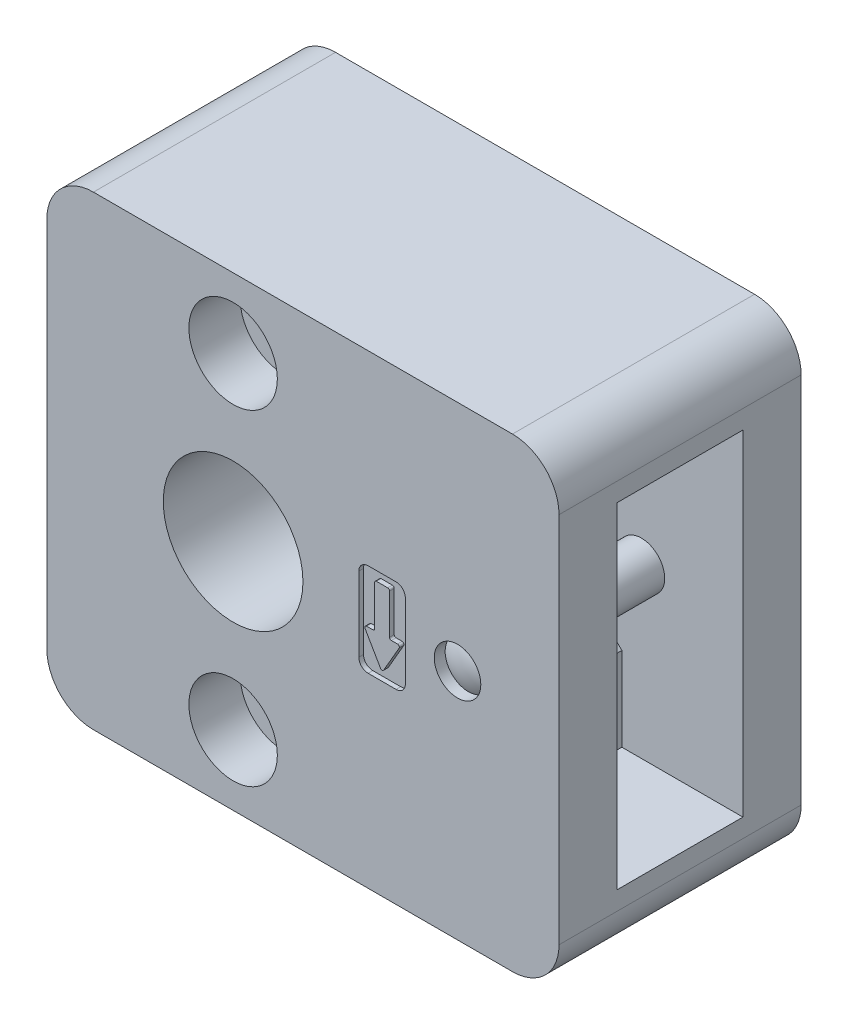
ISO-10303-21;
HEADER;
FILE_DESCRIPTION(('STEP AP214'),'2;1');
FILE_NAME('part.step','',(''),(''),'','','');
FILE_SCHEMA(('AUTOMOTIVE_DESIGN { 1 0 10303 214 1 1 1 1 }'));
ENDSEC;
DATA;
#1=APPLICATION_CONTEXT('core data for automotive mechanical design processes');
#2=APPLICATION_PROTOCOL_DEFINITION('international standard','automotive_design',2000,#1);
#3=PRODUCT_CONTEXT('',#1,'mechanical');
#4=PRODUCT('Part','Part','',(#3));
#5=PRODUCT_RELATED_PRODUCT_CATEGORY('part','',(#4));
#6=PRODUCT_DEFINITION_FORMATION('','',#4);
#7=PRODUCT_DEFINITION_CONTEXT('part definition',#1,'design');
#8=PRODUCT_DEFINITION('design','',#6,#7);
#9=PRODUCT_DEFINITION_SHAPE('','',#8);
#10=(LENGTH_UNIT() NAMED_UNIT(*) SI_UNIT(.MILLI.,.METRE.));
#11=(NAMED_UNIT(*) PLANE_ANGLE_UNIT() SI_UNIT($,.RADIAN.));
#12=(NAMED_UNIT(*) SI_UNIT($,.STERADIAN.) SOLID_ANGLE_UNIT());
#13=UNCERTAINTY_MEASURE_WITH_UNIT(LENGTH_MEASURE(1.E-05),#10,'distance_accuracy_value','');
#14=(GEOMETRIC_REPRESENTATION_CONTEXT(3) GLOBAL_UNCERTAINTY_ASSIGNED_CONTEXT((#13)) GLOBAL_UNIT_ASSIGNED_CONTEXT((#10,
#11,#12)) REPRESENTATION_CONTEXT('',''));
#15=CARTESIAN_POINT('',(0.,0.,0.));
#16=DIRECTION('',(0.,0.,1.));
#17=DIRECTION('',(1.,0.,0.));
#18=AXIS2_PLACEMENT_3D('',#15,#16,#17);
#19=CARTESIAN_POINT('',(24.1,0.,20.5));
#20=DIRECTION('',(0.,0.,1.));
#21=DIRECTION('',(0.423039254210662,-0.906111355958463,0.));
#22=AXIS2_PLACEMENT_3D('',#19,#20,#21);
#23=SPHERICAL_SURFACE('',#22,5.);
#24=CARTESIAN_POINT('',(24.1,0.,24.8301270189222));
#25=DIRECTION('',(0.,0.,-1.));
#26=DIRECTION('',(-0.423039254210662,0.906111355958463,0.));
#27=AXIS2_PLACEMENT_3D('',#24,#25,#26);
#28=CIRCLE('',#27,2.5);
#29=CARTESIAN_POINT('',(23.0424018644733,2.26527838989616,24.8301270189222));
#30=VERTEX_POINT('',#29);
#31=EDGE_CURVE('E931',#30,#30,#28,.F.);
#32=ORIENTED_EDGE('',*,*,#31,.T.);
#33=EDGE_LOOP('',(#32));
#34=FACE_BOUND('',#33,.T.);
#35=ADVANCED_FACE('F14',(#34),#23,.T.);
#36=CARTESIAN_POINT('',(24.1,0.,0.5));
#37=DIRECTION('',(0.,0.,1.));
#38=DIRECTION('',(0.423039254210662,-0.906111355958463,0.));
#39=AXIS2_PLACEMENT_3D('',#36,#37,#38);
#40=CYLINDRICAL_SURFACE('',#39,2.5);
#41=CARTESIAN_POINT('',(24.1,0.,19.75));
#42=DIRECTION('',(0.,0.,-1.));
#43=DIRECTION('',(-1.,0.,0.));
#44=AXIS2_PLACEMENT_3D('',#41,#42,#43);
#45=CIRCLE('',#44,2.5);
#46=CARTESIAN_POINT('',(21.6,0.,19.75));
#47=VERTEX_POINT('',#46);
#48=EDGE_CURVE('E22',#47,#47,#45,.T.);
#49=ORIENTED_EDGE('',*,*,#48,.T.);
#50=EDGE_LOOP('',(#49));
#51=FACE_BOUND('',#50,.T.);
#52=CARTESIAN_POINT('',(24.1,0.,6.25));
#53=DIRECTION('',(0.,0.,-1.));
#54=DIRECTION('',(-1.,0.,0.));
#55=AXIS2_PLACEMENT_3D('',#52,#53,#54);
#56=CIRCLE('',#55,2.5);
#57=CARTESIAN_POINT('',(21.6,0.,6.25));
#58=VERTEX_POINT('',#57);
#59=EDGE_CURVE('E9',#58,#58,#56,.T.);
#60=ORIENTED_EDGE('',*,*,#59,.F.);
#61=EDGE_LOOP('',(#60));
#62=FACE_BOUND('',#61,.T.);
#63=ADVANCED_FACE('F16',(#51,#62),#40,.T.);
#64=CARTESIAN_POINT('',(24.1,0.,0.5));
#65=DIRECTION('',(0.,0.,-1.));
#66=DIRECTION('',(-0.423039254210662,0.906111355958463,0.));
#67=AXIS2_PLACEMENT_3D('',#64,#65,#66);
#68=PLANE('',#67);
#69=CARTESIAN_POINT('',(24.1,0.,0.5));
#70=DIRECTION('',(0.,0.,-1.));
#71=DIRECTION('',(-0.423039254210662,0.906111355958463,0.));
#72=AXIS2_PLACEMENT_3D('',#69,#70,#71);
#73=CIRCLE('',#72,2.2856406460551);
#74=CARTESIAN_POINT('',(23.1330842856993,2.07104494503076,0.5));
#75=VERTEX_POINT('',#74);
#76=EDGE_CURVE('E932',#75,#75,#73,.T.);
#77=ORIENTED_EDGE('',*,*,#76,.T.);
#78=EDGE_LOOP('',(#77));
#79=FACE_BOUND('',#78,.T.);
#80=ADVANCED_FACE('F978',(#79),#68,.T.);
#81=CARTESIAN_POINT('',(24.1,0.,0.5));
#82=DIRECTION('',(0.,0.,1.));
#83=DIRECTION('',(0.423039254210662,-0.906111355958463,0.));
#84=AXIS2_PLACEMENT_3D('',#81,#82,#83);
#85=CONICAL_SURFACE('',#84,2.2856406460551,0.261799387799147);
#86=CARTESIAN_POINT('',(24.1,0.,1.3));
#87=DIRECTION('',(0.,0.,-1.));
#88=DIRECTION('',(-0.423039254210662,0.906111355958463,0.));
#89=AXIS2_PLACEMENT_3D('',#86,#87,#88);
#90=CIRCLE('',#89,2.5);
#91=CARTESIAN_POINT('',(23.0424018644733,2.26527838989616,1.3));
#92=VERTEX_POINT('',#91);
#93=EDGE_CURVE('E935',#92,#92,#90,.F.);
#94=ORIENTED_EDGE('',*,*,#93,.F.);
#95=EDGE_LOOP('',(#94));
#96=FACE_BOUND('',#95,.T.);
#97=ORIENTED_EDGE('',*,*,#76,.F.);
#98=EDGE_LOOP('',(#97));
#99=FACE_BOUND('',#98,.T.);
#100=ADVANCED_FACE('F980',(#96,#99),#85,.T.);
#101=CARTESIAN_POINT('',(-20.,25.,0.));
#102=DIRECTION('',(0.,0.,-1.));
#103=DIRECTION('',(-1.,0.,0.));
#104=AXIS2_PLACEMENT_3D('',#101,#102,#103);
#105=PLANE('',#104);
#106=CARTESIAN_POINT('',(16.,-3.76410161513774,0.));
#107=DIRECTION('',(0.,0.,1.));
#108=DIRECTION('',(-1.,0.,0.));
#109=AXIS2_PLACEMENT_3D('',#106,#107,#108);
#110=CIRCLE('',#109,0.2);
#111=CARTESIAN_POINT('',(15.8267949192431,-3.86410161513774,0.));
#112=VERTEX_POINT('',#111);
#113=CARTESIAN_POINT('',(16.1732050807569,-3.86410161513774,0.));
#114=VERTEX_POINT('',#113);
#115=EDGE_CURVE('E431',#112,#114,#110,.T.);
#116=ORIENTED_EDGE('',*,*,#115,.F.);
#117=DIRECTION('',(0.5,-0.866025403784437,0.));
#118=VECTOR('',#117,1.);
#119=CARTESIAN_POINT('',(14.1732050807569,-1.,0.));
#120=LINE('',#119,#118);
#121=CARTESIAN_POINT('',(14.1732050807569,-1.,0.));
#122=VERTEX_POINT('',#121);
#123=EDGE_CURVE('E429',#122,#112,#120,.T.);
#124=ORIENTED_EDGE('',*,*,#123,.F.);
#125=CARTESIAN_POINT('',(14.3464101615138,-0.9,0.));
#126=DIRECTION('',(0.,0.,1.));
#127=DIRECTION('',(-1.,0.,0.));
#128=AXIS2_PLACEMENT_3D('',#125,#126,#127);
#129=CIRCLE('',#128,0.2);
#130=CARTESIAN_POINT('',(14.3464101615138,-0.7,0.));
#131=VERTEX_POINT('',#130);
#132=EDGE_CURVE('E407',#131,#122,#129,.T.);
#133=ORIENTED_EDGE('',*,*,#132,.F.);
#134=DIRECTION('',(-1.,0.,0.));
#135=VECTOR('',#134,1.);
#136=CARTESIAN_POINT('',(15.,-0.7,0.));
#137=LINE('',#136,#135);
#138=CARTESIAN_POINT('',(15.,-0.7,0.));
#139=VERTEX_POINT('',#138);
#140=EDGE_CURVE('E417',#139,#131,#137,.T.);
#141=ORIENTED_EDGE('',*,*,#140,.F.);
#142=CARTESIAN_POINT('',(15.,-0.5,0.));
#143=DIRECTION('',(0.,0.,-1.));
#144=DIRECTION('',(-1.,0.,0.));
#145=AXIS2_PLACEMENT_3D('',#142,#143,#144);
#146=CIRCLE('',#145,0.2);
#147=CARTESIAN_POINT('',(15.2,-0.5,0.));
#148=VERTEX_POINT('',#147);
#149=EDGE_CURVE('E423',#148,#139,#146,.T.);
#150=ORIENTED_EDGE('',*,*,#149,.F.);
#151=DIRECTION('',(0.,-1.,0.));
#152=VECTOR('',#151,1.);
#153=CARTESIAN_POINT('',(15.2,3.8,0.));
#154=LINE('',#153,#152);
#155=CARTESIAN_POINT('',(15.2,3.8,0.));
#156=VERTEX_POINT('',#155);
#157=EDGE_CURVE('E436',#156,#148,#154,.T.);
#158=ORIENTED_EDGE('',*,*,#157,.F.);
#159=CARTESIAN_POINT('',(15.4,3.8,0.));
#160=DIRECTION('',(0.,0.,1.));
#161=DIRECTION('',(-1.,0.,0.));
#162=AXIS2_PLACEMENT_3D('',#159,#160,#161);
#163=CIRCLE('',#162,0.2);
#164=CARTESIAN_POINT('',(15.4,4.,0.));
#165=VERTEX_POINT('',#164);
#166=EDGE_CURVE('E439',#165,#156,#163,.T.);
#167=ORIENTED_EDGE('',*,*,#166,.F.);
#168=DIRECTION('',(-1.,0.,0.));
#169=VECTOR('',#168,1.);
#170=CARTESIAN_POINT('',(15.4,4.,0.));
#171=LINE('',#170,#169);
#172=CARTESIAN_POINT('',(16.6,4.,0.));
#173=VERTEX_POINT('',#172);
#174=EDGE_CURVE('E442',#173,#165,#171,.T.);
#175=ORIENTED_EDGE('',*,*,#174,.F.);
#176=CARTESIAN_POINT('',(16.6,3.8,0.));
#177=DIRECTION('',(0.,0.,1.));
#178=DIRECTION('',(1.,0.,0.));
#179=AXIS2_PLACEMENT_3D('',#176,#177,#178);
#180=CIRCLE('',#179,0.2);
#181=CARTESIAN_POINT('',(16.8,3.8,0.));
#182=VERTEX_POINT('',#181);
#183=EDGE_CURVE('E445',#182,#173,#180,.T.);
#184=ORIENTED_EDGE('',*,*,#183,.F.);
#185=DIRECTION('',(0.,1.,0.));
#186=VECTOR('',#185,1.);
#187=CARTESIAN_POINT('',(16.8,3.8,0.));
#188=LINE('',#187,#186);
#189=CARTESIAN_POINT('',(16.8,-0.5,0.));
#190=VERTEX_POINT('',#189);
#191=EDGE_CURVE('E448',#190,#182,#188,.T.);
#192=ORIENTED_EDGE('',*,*,#191,.F.);
#193=CARTESIAN_POINT('',(17.,-0.5,0.));
#194=DIRECTION('',(0.,0.,-1.));
#195=DIRECTION('',(1.,0.,0.));
#196=AXIS2_PLACEMENT_3D('',#193,#194,#195);
#197=CIRCLE('',#196,0.2);
#198=CARTESIAN_POINT('',(17.,-0.7,0.));
#199=VERTEX_POINT('',#198);
#200=EDGE_CURVE('E451',#199,#190,#197,.T.);
#201=ORIENTED_EDGE('',*,*,#200,.F.);
#202=DIRECTION('',(-1.,0.,0.));
#203=VECTOR('',#202,1.);
#204=CARTESIAN_POINT('',(17.,-0.7,0.));
#205=LINE('',#204,#203);
#206=CARTESIAN_POINT('',(17.6535898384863,-0.7,0.));
#207=VERTEX_POINT('',#206);
#208=EDGE_CURVE('E454',#207,#199,#205,.T.);
#209=ORIENTED_EDGE('',*,*,#208,.F.);
#210=CARTESIAN_POINT('',(17.6535898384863,-0.9,0.));
#211=DIRECTION('',(0.,0.,1.));
#212=DIRECTION('',(1.,0.,0.));
#213=AXIS2_PLACEMENT_3D('',#210,#211,#212);
#214=CIRCLE('',#213,0.2);
#215=CARTESIAN_POINT('',(17.8267949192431,-1.,0.));
#216=VERTEX_POINT('',#215);
#217=EDGE_CURVE('E457',#216,#207,#214,.T.);
#218=ORIENTED_EDGE('',*,*,#217,.F.);
#219=DIRECTION('',(0.5,0.866025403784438,0.));
#220=VECTOR('',#219,1.);
#221=CARTESIAN_POINT('',(17.8267949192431,-1.,0.));
#222=LINE('',#221,#220);
#223=EDGE_CURVE('E460',#114,#216,#222,.T.);
#224=ORIENTED_EDGE('',*,*,#223,.F.);
#225=EDGE_LOOP('',(#116,#124,#133,#141,#150,#158,#167,#175,#184,#192,#201,#209,#218,#224));
#226=FACE_BOUND('',#225,.T.);
#227=ADVANCED_FACE('F427',(#226),#105,.T.);
#228=CARTESIAN_POINT('',(-20.,25.,26.));
#229=DIRECTION('',(0.,0.,-1.));
#230=DIRECTION('',(-1.,0.,0.));
#231=AXIS2_PLACEMENT_3D('',#228,#229,#230);
#232=PLANE('',#231);
#233=CARTESIAN_POINT('',(16.,-3.76410161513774,26.));
#234=DIRECTION('',(0.,0.,1.));
#235=DIRECTION('',(-1.,0.,0.));
#236=AXIS2_PLACEMENT_3D('',#233,#234,#235);
#237=CIRCLE('',#236,0.2);
#238=CARTESIAN_POINT('',(15.8267949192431,-3.86410161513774,26.));
#239=VERTEX_POINT('',#238);
#240=CARTESIAN_POINT('',(16.1732050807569,-3.86410161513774,26.));
#241=VERTEX_POINT('',#240);
#242=EDGE_CURVE('E559',#239,#241,#237,.T.);
#243=ORIENTED_EDGE('',*,*,#242,.T.);
#244=DIRECTION('',(0.5,0.866025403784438,0.));
#245=VECTOR('',#244,1.);
#246=CARTESIAN_POINT('',(17.8267949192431,-1.,26.));
#247=LINE('',#246,#245);
#248=CARTESIAN_POINT('',(17.8267949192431,-1.,26.));
#249=VERTEX_POINT('',#248);
#250=EDGE_CURVE('E576',#241,#249,#247,.T.);
#251=ORIENTED_EDGE('',*,*,#250,.T.);
#252=CARTESIAN_POINT('',(17.6535898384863,-0.9,26.));
#253=DIRECTION('',(0.,0.,1.));
#254=DIRECTION('',(1.,0.,0.));
#255=AXIS2_PLACEMENT_3D('',#252,#253,#254);
#256=CIRCLE('',#255,0.2);
#257=CARTESIAN_POINT('',(17.6535898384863,-0.7,26.));
#258=VERTEX_POINT('',#257);
#259=EDGE_CURVE('E579',#249,#258,#256,.T.);
#260=ORIENTED_EDGE('',*,*,#259,.T.);
#261=DIRECTION('',(-1.,0.,0.));
#262=VECTOR('',#261,1.);
#263=CARTESIAN_POINT('',(17.,-0.7,26.));
#264=LINE('',#263,#262);
#265=CARTESIAN_POINT('',(17.,-0.7,26.));
#266=VERTEX_POINT('',#265);
#267=EDGE_CURVE('E582',#258,#266,#264,.T.);
#268=ORIENTED_EDGE('',*,*,#267,.T.);
#269=CARTESIAN_POINT('',(17.,-0.5,26.));
#270=DIRECTION('',(0.,0.,-1.));
#271=DIRECTION('',(1.,0.,0.));
#272=AXIS2_PLACEMENT_3D('',#269,#270,#271);
#273=CIRCLE('',#272,0.2);
#274=CARTESIAN_POINT('',(16.8,-0.5,26.));
#275=VERTEX_POINT('',#274);
#276=EDGE_CURVE('E585',#266,#275,#273,.T.);
#277=ORIENTED_EDGE('',*,*,#276,.T.);
#278=DIRECTION('',(0.,1.,0.));
#279=VECTOR('',#278,1.);
#280=CARTESIAN_POINT('',(16.8,3.8,26.));
#281=LINE('',#280,#279);
#282=CARTESIAN_POINT('',(16.8,3.8,26.));
#283=VERTEX_POINT('',#282);
#284=EDGE_CURVE('E588',#275,#283,#281,.T.);
#285=ORIENTED_EDGE('',*,*,#284,.T.);
#286=CARTESIAN_POINT('',(16.6,3.8,26.));
#287=DIRECTION('',(0.,0.,1.));
#288=DIRECTION('',(1.,0.,0.));
#289=AXIS2_PLACEMENT_3D('',#286,#287,#288);
#290=CIRCLE('',#289,0.2);
#291=CARTESIAN_POINT('',(16.6,4.,26.));
#292=VERTEX_POINT('',#291);
#293=EDGE_CURVE('E591',#283,#292,#290,.T.);
#294=ORIENTED_EDGE('',*,*,#293,.T.);
#295=DIRECTION('',(-1.,0.,0.));
#296=VECTOR('',#295,1.);
#297=CARTESIAN_POINT('',(15.4,4.,26.));
#298=LINE('',#297,#296);
#299=CARTESIAN_POINT('',(15.4,4.,26.));
#300=VERTEX_POINT('',#299);
#301=EDGE_CURVE('E594',#292,#300,#298,.T.);
#302=ORIENTED_EDGE('',*,*,#301,.T.);
#303=CARTESIAN_POINT('',(15.4,3.8,26.));
#304=DIRECTION('',(0.,0.,1.));
#305=DIRECTION('',(-1.,0.,0.));
#306=AXIS2_PLACEMENT_3D('',#303,#304,#305);
#307=CIRCLE('',#306,0.2);
#308=CARTESIAN_POINT('',(15.2,3.8,26.));
#309=VERTEX_POINT('',#308);
#310=EDGE_CURVE('E597',#300,#309,#307,.T.);
#311=ORIENTED_EDGE('',*,*,#310,.T.);
#312=DIRECTION('',(0.,-1.,0.));
#313=VECTOR('',#312,1.);
#314=CARTESIAN_POINT('',(15.2,3.8,26.));
#315=LINE('',#314,#313);
#316=CARTESIAN_POINT('',(15.2,-0.5,26.));
#317=VERTEX_POINT('',#316);
#318=EDGE_CURVE('E600',#309,#317,#315,.T.);
#319=ORIENTED_EDGE('',*,*,#318,.T.);
#320=CARTESIAN_POINT('',(15.,-0.5,26.));
#321=DIRECTION('',(0.,0.,-1.));
#322=DIRECTION('',(-1.,0.,0.));
#323=AXIS2_PLACEMENT_3D('',#320,#321,#322);
#324=CIRCLE('',#323,0.2);
#325=CARTESIAN_POINT('',(15.,-0.7,26.));
#326=VERTEX_POINT('',#325);
#327=EDGE_CURVE('E603',#317,#326,#324,.T.);
#328=ORIENTED_EDGE('',*,*,#327,.T.);
#329=DIRECTION('',(-1.,0.,0.));
#330=VECTOR('',#329,1.);
#331=CARTESIAN_POINT('',(15.,-0.7,26.));
#332=LINE('',#331,#330);
#333=CARTESIAN_POINT('',(14.3464101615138,-0.7,26.));
#334=VERTEX_POINT('',#333);
#335=EDGE_CURVE('E606',#326,#334,#332,.T.);
#336=ORIENTED_EDGE('',*,*,#335,.T.);
#337=CARTESIAN_POINT('',(14.3464101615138,-0.9,26.));
#338=DIRECTION('',(0.,0.,1.));
#339=DIRECTION('',(-1.,0.,0.));
#340=AXIS2_PLACEMENT_3D('',#337,#338,#339);
#341=CIRCLE('',#340,0.2);
#342=CARTESIAN_POINT('',(14.1732050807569,-1.,26.));
#343=VERTEX_POINT('',#342);
#344=EDGE_CURVE('E609',#334,#343,#341,.T.);
#345=ORIENTED_EDGE('',*,*,#344,.T.);
#346=DIRECTION('',(0.5,-0.866025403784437,0.));
#347=VECTOR('',#346,1.);
#348=CARTESIAN_POINT('',(14.1732050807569,-1.,26.));
#349=LINE('',#348,#347);
#350=EDGE_CURVE('E612',#343,#239,#349,.T.);
#351=ORIENTED_EDGE('',*,*,#350,.T.);
#352=EDGE_LOOP('',(#243,#251,#260,#268,#277,#285,#294,#302,#311,#319,#328,#336,#345,#351));
#353=FACE_BOUND('',#352,.T.);
#354=ADVANCED_FACE('F1006',(#353),#232,.F.);
#355=CARTESIAN_POINT('',(14.1732050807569,-1.,0.5));
#356=DIRECTION('',(0.866025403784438,0.5,0.));
#357=DIRECTION('',(-0.5,0.866025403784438,0.));
#358=AXIS2_PLACEMENT_3D('',#355,#356,#357);
#359=PLANE('',#358);
#360=ORIENTED_EDGE('',*,*,#123,.T.);
#361=DIRECTION('',(0.,0.,-1.));
#362=VECTOR('',#361,1.);
#363=CARTESIAN_POINT('',(15.8267949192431,-3.86410161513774,0.5));
#364=LINE('',#363,#362);
#365=CARTESIAN_POINT('',(15.8267949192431,-3.86410161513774,0.5));
#366=VERTEX_POINT('',#365);
#367=EDGE_CURVE('E490',#366,#112,#364,.T.);
#368=ORIENTED_EDGE('',*,*,#367,.F.);
#369=DIRECTION('',(0.5,-0.866025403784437,0.));
#370=VECTOR('',#369,1.);
#371=CARTESIAN_POINT('',(14.1732050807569,-1.,0.5));
#372=LINE('',#371,#370);
#373=CARTESIAN_POINT('',(14.1732050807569,-1.,0.5));
#374=VERTEX_POINT('',#373);
#375=EDGE_CURVE('E465',#374,#366,#372,.T.);
#376=ORIENTED_EDGE('',*,*,#375,.F.);
#377=DIRECTION('',(0.,0.,-1.));
#378=VECTOR('',#377,1.);
#379=CARTESIAN_POINT('',(14.1732050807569,-1.,0.5));
#380=LINE('',#379,#378);
#381=EDGE_CURVE('E414',#374,#122,#380,.T.);
#382=ORIENTED_EDGE('',*,*,#381,.T.);
#383=EDGE_LOOP('',(#360,#368,#376,#382));
#384=FACE_BOUND('',#383,.T.);
#385=ADVANCED_FACE('F1008',(#384),#359,.F.);
#386=CARTESIAN_POINT('',(14.3464101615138,-0.9,0.5));
#387=DIRECTION('',(0.,0.,-1.));
#388=DIRECTION('',(-1.,0.,0.));
#389=AXIS2_PLACEMENT_3D('',#386,#387,#388);
#390=CYLINDRICAL_SURFACE('',#389,0.2);
#391=ORIENTED_EDGE('',*,*,#132,.T.);
#392=ORIENTED_EDGE('',*,*,#381,.F.);
#393=CARTESIAN_POINT('',(14.3464101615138,-0.9,0.5));
#394=DIRECTION('',(0.,0.,1.));
#395=DIRECTION('',(-1.,0.,0.));
#396=AXIS2_PLACEMENT_3D('',#393,#394,#395);
#397=CIRCLE('',#396,0.2);
#398=CARTESIAN_POINT('',(14.3464101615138,-0.7,0.5));
#399=VERTEX_POINT('',#398);
#400=EDGE_CURVE('E410',#399,#374,#397,.T.);
#401=ORIENTED_EDGE('',*,*,#400,.F.);
#402=DIRECTION('',(0.,0.,-1.));
#403=VECTOR('',#402,1.);
#404=CARTESIAN_POINT('',(14.3464101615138,-0.7,0.5));
#405=LINE('',#404,#403);
#406=EDGE_CURVE('E403',#399,#131,#405,.T.);
#407=ORIENTED_EDGE('',*,*,#406,.T.);
#408=EDGE_LOOP('',(#391,#392,#401,#407));
#409=FACE_BOUND('',#408,.T.);
#410=ADVANCED_FACE('F405',(#409),#390,.T.);
#411=CARTESIAN_POINT('',(15.,-0.7,0.5));
#412=DIRECTION('',(0.,-1.,0.));
#413=DIRECTION('',(1.,0.,0.));
#414=AXIS2_PLACEMENT_3D('',#411,#412,#413);
#415=PLANE('',#414);
#416=ORIENTED_EDGE('',*,*,#140,.T.);
#417=ORIENTED_EDGE('',*,*,#406,.F.);
#418=DIRECTION('',(-1.,0.,0.));
#419=VECTOR('',#418,1.);
#420=CARTESIAN_POINT('',(15.,-0.7,0.5));
#421=LINE('',#420,#419);
#422=CARTESIAN_POINT('',(15.,-0.7,0.5));
#423=VERTEX_POINT('',#422);
#424=EDGE_CURVE('E468',#423,#399,#421,.T.);
#425=ORIENTED_EDGE('',*,*,#424,.F.);
#426=DIRECTION('',(0.,0.,-1.));
#427=VECTOR('',#426,1.);
#428=CARTESIAN_POINT('',(15.,-0.7,0.5));
#429=LINE('',#428,#427);
#430=EDGE_CURVE('E413',#423,#139,#429,.T.);
#431=ORIENTED_EDGE('',*,*,#430,.T.);
#432=EDGE_LOOP('',(#416,#417,#425,#431));
#433=FACE_BOUND('',#432,.T.);
#434=ADVANCED_FACE('F418',(#433),#415,.F.);
#435=CARTESIAN_POINT('',(15.,-0.5,0.5));
#436=DIRECTION('',(0.,0.,-1.));
#437=DIRECTION('',(-1.,0.,0.));
#438=AXIS2_PLACEMENT_3D('',#435,#436,#437);
#439=CYLINDRICAL_SURFACE('',#438,0.2);
#440=ORIENTED_EDGE('',*,*,#149,.T.);
#441=ORIENTED_EDGE('',*,*,#430,.F.);
#442=CARTESIAN_POINT('',(15.,-0.5,0.5));
#443=DIRECTION('',(0.,0.,-1.));
#444=DIRECTION('',(-1.,0.,0.));
#445=AXIS2_PLACEMENT_3D('',#442,#443,#444);
#446=CIRCLE('',#445,0.2);
#447=CARTESIAN_POINT('',(15.2,-0.5,0.5));
#448=VERTEX_POINT('',#447);
#449=EDGE_CURVE('E470',#448,#423,#446,.T.);
#450=ORIENTED_EDGE('',*,*,#449,.F.);
#451=DIRECTION('',(0.,0.,-1.));
#452=VECTOR('',#451,1.);
#453=CARTESIAN_POINT('',(15.2,-0.5,0.5));
#454=LINE('',#453,#452);
#455=EDGE_CURVE('E510',#448,#148,#454,.T.);
#456=ORIENTED_EDGE('',*,*,#455,.T.);
#457=EDGE_LOOP('',(#440,#441,#450,#456));
#458=FACE_BOUND('',#457,.T.);
#459=ADVANCED_FACE('F1168',(#458),#439,.F.);
#460=CARTESIAN_POINT('',(15.2,3.8,0.5));
#461=DIRECTION('',(1.,0.,0.));
#462=DIRECTION('',(0.,1.,0.));
#463=AXIS2_PLACEMENT_3D('',#460,#461,#462);
#464=PLANE('',#463);
#465=ORIENTED_EDGE('',*,*,#157,.T.);
#466=ORIENTED_EDGE('',*,*,#455,.F.);
#467=DIRECTION('',(0.,-1.,0.));
#468=VECTOR('',#467,1.);
#469=CARTESIAN_POINT('',(15.2,3.8,0.5));
#470=LINE('',#469,#468);
#471=CARTESIAN_POINT('',(15.2,3.8,0.5));
#472=VERTEX_POINT('',#471);
#473=EDGE_CURVE('E472',#472,#448,#470,.T.);
#474=ORIENTED_EDGE('',*,*,#473,.F.);
#475=DIRECTION('',(0.,0.,-1.));
#476=VECTOR('',#475,1.);
#477=CARTESIAN_POINT('',(15.2,3.8,0.5));
#478=LINE('',#477,#476);
#479=EDGE_CURVE('E508',#472,#156,#478,.T.);
#480=ORIENTED_EDGE('',*,*,#479,.T.);
#481=EDGE_LOOP('',(#465,#466,#474,#480));
#482=FACE_BOUND('',#481,.T.);
#483=ADVANCED_FACE('F1164',(#482),#464,.F.);
#484=CARTESIAN_POINT('',(15.4,3.8,0.5));
#485=DIRECTION('',(0.,0.,-1.));
#486=DIRECTION('',(-1.,0.,0.));
#487=AXIS2_PLACEMENT_3D('',#484,#485,#486);
#488=CYLINDRICAL_SURFACE('',#487,0.2);
#489=ORIENTED_EDGE('',*,*,#166,.T.);
#490=ORIENTED_EDGE('',*,*,#479,.F.);
#491=CARTESIAN_POINT('',(15.4,3.8,0.5));
#492=DIRECTION('',(0.,0.,1.));
#493=DIRECTION('',(-1.,0.,0.));
#494=AXIS2_PLACEMENT_3D('',#491,#492,#493);
#495=CIRCLE('',#494,0.2);
#496=CARTESIAN_POINT('',(15.4,4.,0.5));
#497=VERTEX_POINT('',#496);
#498=EDGE_CURVE('E474',#497,#472,#495,.T.);
#499=ORIENTED_EDGE('',*,*,#498,.F.);
#500=DIRECTION('',(0.,0.,-1.));
#501=VECTOR('',#500,1.);
#502=CARTESIAN_POINT('',(15.4,4.,0.5));
#503=LINE('',#502,#501);
#504=EDGE_CURVE('E506',#497,#165,#503,.T.);
#505=ORIENTED_EDGE('',*,*,#504,.T.);
#506=EDGE_LOOP('',(#489,#490,#499,#505));
#507=FACE_BOUND('',#506,.T.);
#508=ADVANCED_FACE('F1160',(#507),#488,.T.);
#509=CARTESIAN_POINT('',(15.4,4.,0.5));
#510=DIRECTION('',(0.,-1.,0.));
#511=DIRECTION('',(0.,0.,-1.));
#512=AXIS2_PLACEMENT_3D('',#509,#510,#511);
#513=PLANE('',#512);
#514=ORIENTED_EDGE('',*,*,#174,.T.);
#515=ORIENTED_EDGE('',*,*,#504,.F.);
#516=DIRECTION('',(-1.,0.,0.));
#517=VECTOR('',#516,1.);
#518=CARTESIAN_POINT('',(15.4,4.,0.5));
#519=LINE('',#518,#517);
#520=CARTESIAN_POINT('',(16.6,4.,0.5));
#521=VERTEX_POINT('',#520);
#522=EDGE_CURVE('E476',#521,#497,#519,.T.);
#523=ORIENTED_EDGE('',*,*,#522,.F.);
#524=DIRECTION('',(0.,0.,-1.));
#525=VECTOR('',#524,1.);
#526=CARTESIAN_POINT('',(16.6,4.,0.5));
#527=LINE('',#526,#525);
#528=EDGE_CURVE('E504',#521,#173,#527,.T.);
#529=ORIENTED_EDGE('',*,*,#528,.T.);
#530=EDGE_LOOP('',(#514,#515,#523,#529));
#531=FACE_BOUND('',#530,.T.);
#532=ADVANCED_FACE('F1156',(#531),#513,.F.);
#533=CARTESIAN_POINT('',(16.6,3.8,0.5));
#534=DIRECTION('',(0.,0.,-1.));
#535=DIRECTION('',(-1.,0.,0.));
#536=AXIS2_PLACEMENT_3D('',#533,#534,#535);
#537=CYLINDRICAL_SURFACE('',#536,0.2);
#538=ORIENTED_EDGE('',*,*,#183,.T.);
#539=ORIENTED_EDGE('',*,*,#528,.F.);
#540=CARTESIAN_POINT('',(16.6,3.8,0.5));
#541=DIRECTION('',(0.,0.,1.));
#542=DIRECTION('',(1.,0.,0.));
#543=AXIS2_PLACEMENT_3D('',#540,#541,#542);
#544=CIRCLE('',#543,0.2);
#545=CARTESIAN_POINT('',(16.8,3.8,0.5));
#546=VERTEX_POINT('',#545);
#547=EDGE_CURVE('E478',#546,#521,#544,.T.);
#548=ORIENTED_EDGE('',*,*,#547,.F.);
#549=DIRECTION('',(0.,0.,-1.));
#550=VECTOR('',#549,1.);
#551=CARTESIAN_POINT('',(16.8,3.8,0.5));
#552=LINE('',#551,#550);
#553=EDGE_CURVE('E502',#546,#182,#552,.T.);
#554=ORIENTED_EDGE('',*,*,#553,.T.);
#555=EDGE_LOOP('',(#538,#539,#548,#554));
#556=FACE_BOUND('',#555,.T.);
#557=ADVANCED_FACE('F1152',(#556),#537,.T.);
#558=CARTESIAN_POINT('',(16.8,3.8,0.5));
#559=DIRECTION('',(-1.,0.,0.));
#560=DIRECTION('',(0.,0.,1.));
#561=AXIS2_PLACEMENT_3D('',#558,#559,#560);
#562=PLANE('',#561);
#563=ORIENTED_EDGE('',*,*,#191,.T.);
#564=ORIENTED_EDGE('',*,*,#553,.F.);
#565=DIRECTION('',(0.,1.,0.));
#566=VECTOR('',#565,1.);
#567=CARTESIAN_POINT('',(16.8,3.8,0.5));
#568=LINE('',#567,#566);
#569=CARTESIAN_POINT('',(16.8,-0.5,0.5));
#570=VERTEX_POINT('',#569);
#571=EDGE_CURVE('E480',#570,#546,#568,.T.);
#572=ORIENTED_EDGE('',*,*,#571,.F.);
#573=DIRECTION('',(0.,0.,-1.));
#574=VECTOR('',#573,1.);
#575=CARTESIAN_POINT('',(16.8,-0.5,0.5));
#576=LINE('',#575,#574);
#577=EDGE_CURVE('E500',#570,#190,#576,.T.);
#578=ORIENTED_EDGE('',*,*,#577,.T.);
#579=EDGE_LOOP('',(#563,#564,#572,#578));
#580=FACE_BOUND('',#579,.T.);
#581=ADVANCED_FACE('F1148',(#580),#562,.F.);
#582=CARTESIAN_POINT('',(17.,-0.5,0.5));
#583=DIRECTION('',(0.,0.,-1.));
#584=DIRECTION('',(-1.,0.,0.));
#585=AXIS2_PLACEMENT_3D('',#582,#583,#584);
#586=CYLINDRICAL_SURFACE('',#585,0.2);
#587=ORIENTED_EDGE('',*,*,#200,.T.);
#588=ORIENTED_EDGE('',*,*,#577,.F.);
#589=CARTESIAN_POINT('',(17.,-0.5,0.5));
#590=DIRECTION('',(0.,0.,-1.));
#591=DIRECTION('',(1.,0.,0.));
#592=AXIS2_PLACEMENT_3D('',#589,#590,#591);
#593=CIRCLE('',#592,0.2);
#594=CARTESIAN_POINT('',(17.,-0.7,0.5));
#595=VERTEX_POINT('',#594);
#596=EDGE_CURVE('E482',#595,#570,#593,.T.);
#597=ORIENTED_EDGE('',*,*,#596,.F.);
#598=DIRECTION('',(0.,0.,-1.));
#599=VECTOR('',#598,1.);
#600=CARTESIAN_POINT('',(17.,-0.7,0.5));
#601=LINE('',#600,#599);
#602=EDGE_CURVE('E498',#595,#199,#601,.T.);
#603=ORIENTED_EDGE('',*,*,#602,.T.);
#604=EDGE_LOOP('',(#587,#588,#597,#603));
#605=FACE_BOUND('',#604,.T.);
#606=ADVANCED_FACE('F1144',(#605),#586,.F.);
#607=CARTESIAN_POINT('',(17.,-0.7,0.5));
#608=DIRECTION('',(0.,-1.,0.));
#609=DIRECTION('',(0.,0.,-1.));
#610=AXIS2_PLACEMENT_3D('',#607,#608,#609);
#611=PLANE('',#610);
#612=ORIENTED_EDGE('',*,*,#208,.T.);
#613=ORIENTED_EDGE('',*,*,#602,.F.);
#614=DIRECTION('',(-1.,0.,0.));
#615=VECTOR('',#614,1.);
#616=CARTESIAN_POINT('',(17.,-0.7,0.5));
#617=LINE('',#616,#615);
#618=CARTESIAN_POINT('',(17.6535898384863,-0.7,0.5));
#619=VERTEX_POINT('',#618);
#620=EDGE_CURVE('E484',#619,#595,#617,.T.);
#621=ORIENTED_EDGE('',*,*,#620,.F.);
#622=DIRECTION('',(0.,0.,-1.));
#623=VECTOR('',#622,1.);
#624=CARTESIAN_POINT('',(17.6535898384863,-0.7,0.5));
#625=LINE('',#624,#623);
#626=EDGE_CURVE('E496',#619,#207,#625,.T.);
#627=ORIENTED_EDGE('',*,*,#626,.T.);
#628=EDGE_LOOP('',(#612,#613,#621,#627));
#629=FACE_BOUND('',#628,.T.);
#630=ADVANCED_FACE('F1140',(#629),#611,.F.);
#631=CARTESIAN_POINT('',(17.6535898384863,-0.9,0.5));
#632=DIRECTION('',(0.,0.,-1.));
#633=DIRECTION('',(-1.,0.,0.));
#634=AXIS2_PLACEMENT_3D('',#631,#632,#633);
#635=CYLINDRICAL_SURFACE('',#634,0.2);
#636=ORIENTED_EDGE('',*,*,#217,.T.);
#637=ORIENTED_EDGE('',*,*,#626,.F.);
#638=CARTESIAN_POINT('',(17.6535898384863,-0.9,0.5));
#639=DIRECTION('',(0.,0.,1.));
#640=DIRECTION('',(1.,0.,0.));
#641=AXIS2_PLACEMENT_3D('',#638,#639,#640);
#642=CIRCLE('',#641,0.2);
#643=CARTESIAN_POINT('',(17.8267949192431,-1.,0.5));
#644=VERTEX_POINT('',#643);
#645=EDGE_CURVE('E486',#644,#619,#642,.T.);
#646=ORIENTED_EDGE('',*,*,#645,.F.);
#647=DIRECTION('',(0.,0.,-1.));
#648=VECTOR('',#647,1.);
#649=CARTESIAN_POINT('',(17.8267949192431,-1.,0.5));
#650=LINE('',#649,#648);
#651=EDGE_CURVE('E494',#644,#216,#650,.T.);
#652=ORIENTED_EDGE('',*,*,#651,.T.);
#653=EDGE_LOOP('',(#636,#637,#646,#652));
#654=FACE_BOUND('',#653,.T.);
#655=ADVANCED_FACE('F1136',(#654),#635,.T.);
#656=CARTESIAN_POINT('',(17.8267949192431,-1.,0.5));
#657=DIRECTION('',(-0.866025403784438,0.5,0.));
#658=DIRECTION('',(-0.5,-0.866025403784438,0.));
#659=AXIS2_PLACEMENT_3D('',#656,#657,#658);
#660=PLANE('',#659);
#661=ORIENTED_EDGE('',*,*,#223,.T.);
#662=ORIENTED_EDGE('',*,*,#651,.F.);
#663=DIRECTION('',(0.5,0.866025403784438,0.));
#664=VECTOR('',#663,1.);
#665=CARTESIAN_POINT('',(17.8267949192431,-1.,0.5));
#666=LINE('',#665,#664);
#667=CARTESIAN_POINT('',(16.1732050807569,-3.86410161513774,0.5));
#668=VERTEX_POINT('',#667);
#669=EDGE_CURVE('E488',#668,#644,#666,.T.);
#670=ORIENTED_EDGE('',*,*,#669,.F.);
#671=DIRECTION('',(0.,0.,-1.));
#672=VECTOR('',#671,1.);
#673=CARTESIAN_POINT('',(16.1732050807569,-3.86410161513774,0.5));
#674=LINE('',#673,#672);
#675=EDGE_CURVE('E491',#668,#114,#674,.T.);
#676=ORIENTED_EDGE('',*,*,#675,.T.);
#677=EDGE_LOOP('',(#661,#662,#670,#676));
#678=FACE_BOUND('',#677,.T.);
#679=ADVANCED_FACE('F1133',(#678),#660,.F.);
#680=CARTESIAN_POINT('',(16.,-3.76410161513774,0.5));
#681=DIRECTION('',(0.,0.,-1.));
#682=DIRECTION('',(-1.,0.,0.));
#683=AXIS2_PLACEMENT_3D('',#680,#681,#682);
#684=CYLINDRICAL_SURFACE('',#683,0.2);
#685=ORIENTED_EDGE('',*,*,#115,.T.);
#686=ORIENTED_EDGE('',*,*,#675,.F.);
#687=CARTESIAN_POINT('',(16.,-3.76410161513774,0.5));
#688=DIRECTION('',(0.,0.,1.));
#689=DIRECTION('',(-1.,0.,0.));
#690=AXIS2_PLACEMENT_3D('',#687,#688,#689);
#691=CIRCLE('',#690,0.2);
#692=EDGE_CURVE('E463',#366,#668,#691,.T.);
#693=ORIENTED_EDGE('',*,*,#692,.F.);
#694=ORIENTED_EDGE('',*,*,#367,.T.);
#695=EDGE_LOOP('',(#685,#686,#693,#694));
#696=FACE_BOUND('',#695,.T.);
#697=ADVANCED_FACE('F1041',(#696),#684,.T.);
#698=CARTESIAN_POINT('',(0.,-17.5,26.));
#699=DIRECTION('',(0.,0.,1.));
#700=DIRECTION('',(1.,0.,0.));
#701=AXIS2_PLACEMENT_3D('',#698,#699,#700);
#702=CYLINDRICAL_SURFACE('',#701,2.75);
#703=CARTESIAN_POINT('',(0.,-17.5,20.5));
#704=DIRECTION('',(0.,0.,1.));
#705=DIRECTION('',(1.,0.,0.));
#706=AXIS2_PLACEMENT_3D('',#703,#704,#705);
#707=CIRCLE('',#706,2.75);
#708=CARTESIAN_POINT('',(2.75,-17.5,20.5));
#709=VERTEX_POINT('',#708);
#710=EDGE_CURVE('E795',#709,#709,#707,.T.);
#711=ORIENTED_EDGE('',*,*,#710,.T.);
#712=EDGE_LOOP('',(#711));
#713=FACE_BOUND('',#712,.T.);
#714=CARTESIAN_POINT('',(0.,-17.5,5.5));
#715=DIRECTION('',(0.,0.,-1.));
#716=DIRECTION('',(-1.,0.,0.));
#717=AXIS2_PLACEMENT_3D('',#714,#715,#716);
#718=CIRCLE('',#717,2.75);
#719=CARTESIAN_POINT('',(-2.75,-17.5,5.5));
#720=VERTEX_POINT('',#719);
#721=EDGE_CURVE('E785',#720,#720,#718,.F.);
#722=ORIENTED_EDGE('',*,*,#721,.F.);
#723=EDGE_LOOP('',(#722));
#724=FACE_BOUND('',#723,.T.);
#725=ADVANCED_FACE('F1024',(#713,#724),#702,.F.);
#726=CARTESIAN_POINT('',(0.,17.5,26.));
#727=DIRECTION('',(0.,0.,1.));
#728=DIRECTION('',(1.,0.,0.));
#729=AXIS2_PLACEMENT_3D('',#726,#727,#728);
#730=CYLINDRICAL_SURFACE('',#729,2.75);
#731=CARTESIAN_POINT('',(0.,17.5,20.5));
#732=DIRECTION('',(0.,0.,1.));
#733=DIRECTION('',(1.,0.,0.));
#734=AXIS2_PLACEMENT_3D('',#731,#732,#733);
#735=CIRCLE('',#734,2.75);
#736=CARTESIAN_POINT('',(2.75,17.5,20.5));
#737=VERTEX_POINT('',#736);
#738=EDGE_CURVE('E786',#737,#737,#735,.T.);
#739=ORIENTED_EDGE('',*,*,#738,.T.);
#740=EDGE_LOOP('',(#739));
#741=FACE_BOUND('',#740,.T.);
#742=CARTESIAN_POINT('',(0.,17.5,5.5));
#743=DIRECTION('',(0.,0.,-1.));
#744=DIRECTION('',(-1.,0.,0.));
#745=AXIS2_PLACEMENT_3D('',#742,#743,#744);
#746=CIRCLE('',#745,2.75);
#747=CARTESIAN_POINT('',(-2.75,17.5,5.5));
#748=VERTEX_POINT('',#747);
#749=EDGE_CURVE('E778',#748,#748,#746,.F.);
#750=ORIENTED_EDGE('',*,*,#749,.F.);
#751=EDGE_LOOP('',(#750));
#752=FACE_BOUND('',#751,.T.);
#753=ADVANCED_FACE('F1012',(#741,#752),#730,.F.);
#754=CARTESIAN_POINT('',(16.,-3.76410161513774,25.5));
#755=DIRECTION('',(0.,0.,1.));
#756=DIRECTION('',(1.,0.,0.));
#757=AXIS2_PLACEMENT_3D('',#754,#755,#756);
#758=CYLINDRICAL_SURFACE('',#757,0.2);
#759=ORIENTED_EDGE('',*,*,#242,.F.);
#760=DIRECTION('',(0.,0.,1.));
#761=VECTOR('',#760,1.);
#762=CARTESIAN_POINT('',(15.8267949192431,-3.86410161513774,25.5));
#763=LINE('',#762,#761);
#764=CARTESIAN_POINT('',(15.8267949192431,-3.86410161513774,25.5));
#765=VERTEX_POINT('',#764);
#766=EDGE_CURVE('E658',#765,#239,#763,.T.);
#767=ORIENTED_EDGE('',*,*,#766,.F.);
#768=CARTESIAN_POINT('',(16.,-3.76410161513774,25.5));
#769=DIRECTION('',(0.,0.,1.));
#770=DIRECTION('',(-1.,0.,0.));
#771=AXIS2_PLACEMENT_3D('',#768,#769,#770);
#772=CIRCLE('',#771,0.2);
#773=CARTESIAN_POINT('',(16.1732050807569,-3.86410161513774,25.5));
#774=VERTEX_POINT('',#773);
#775=EDGE_CURVE('E615',#765,#774,#772,.T.);
#776=ORIENTED_EDGE('',*,*,#775,.T.);
#777=DIRECTION('',(0.,0.,1.));
#778=VECTOR('',#777,1.);
#779=CARTESIAN_POINT('',(16.1732050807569,-3.86410161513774,25.5));
#780=LINE('',#779,#778);
#781=EDGE_CURVE('E657',#774,#241,#780,.T.);
#782=ORIENTED_EDGE('',*,*,#781,.T.);
#783=EDGE_LOOP('',(#759,#767,#776,#782));
#784=FACE_BOUND('',#783,.T.);
#785=ADVANCED_FACE('F1028',(#784),#758,.T.);
#786=CARTESIAN_POINT('',(17.8267949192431,-1.,25.5));
#787=DIRECTION('',(0.866025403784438,-0.5,0.));
#788=DIRECTION('',(0.5,0.866025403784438,0.));
#789=AXIS2_PLACEMENT_3D('',#786,#787,#788);
#790=PLANE('',#789);
#791=ORIENTED_EDGE('',*,*,#250,.F.);
#792=ORIENTED_EDGE('',*,*,#781,.F.);
#793=DIRECTION('',(0.5,0.866025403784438,0.));
#794=VECTOR('',#793,1.);
#795=CARTESIAN_POINT('',(17.8267949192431,-1.,25.5));
#796=LINE('',#795,#794);
#797=CARTESIAN_POINT('',(17.8267949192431,-1.,25.5));
#798=VERTEX_POINT('',#797);
#799=EDGE_CURVE('E618',#774,#798,#796,.T.);
#800=ORIENTED_EDGE('',*,*,#799,.T.);
#801=DIRECTION('',(0.,0.,1.));
#802=VECTOR('',#801,1.);
#803=CARTESIAN_POINT('',(17.8267949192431,-1.,25.5));
#804=LINE('',#803,#802);
#805=EDGE_CURVE('E683',#798,#249,#804,.T.);
#806=ORIENTED_EDGE('',*,*,#805,.T.);
#807=EDGE_LOOP('',(#791,#792,#800,#806));
#808=FACE_BOUND('',#807,.T.);
#809=ADVANCED_FACE('F1036',(#808),#790,.T.);
#810=CARTESIAN_POINT('',(17.6535898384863,-0.9,25.5));
#811=DIRECTION('',(0.,0.,1.));
#812=DIRECTION('',(1.,0.,0.));
#813=AXIS2_PLACEMENT_3D('',#810,#811,#812);
#814=CYLINDRICAL_SURFACE('',#813,0.2);
#815=ORIENTED_EDGE('',*,*,#259,.F.);
#816=ORIENTED_EDGE('',*,*,#805,.F.);
#817=CARTESIAN_POINT('',(17.6535898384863,-0.9,25.5));
#818=DIRECTION('',(0.,0.,1.));
#819=DIRECTION('',(1.,0.,0.));
#820=AXIS2_PLACEMENT_3D('',#817,#818,#819);
#821=CIRCLE('',#820,0.2);
#822=CARTESIAN_POINT('',(17.6535898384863,-0.7,25.5));
#823=VERTEX_POINT('',#822);
#824=EDGE_CURVE('E621',#798,#823,#821,.T.);
#825=ORIENTED_EDGE('',*,*,#824,.T.);
#826=DIRECTION('',(0.,0.,1.));
#827=VECTOR('',#826,1.);
#828=CARTESIAN_POINT('',(17.6535898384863,-0.7,25.5));
#829=LINE('',#828,#827);
#830=EDGE_CURVE('E681',#823,#258,#829,.T.);
#831=ORIENTED_EDGE('',*,*,#830,.T.);
#832=EDGE_LOOP('',(#815,#816,#825,#831));
#833=FACE_BOUND('',#832,.T.);
#834=ADVANCED_FACE('F1261',(#833),#814,.T.);
#835=CARTESIAN_POINT('',(17.,-0.7,25.5));
#836=DIRECTION('',(0.,1.,0.));
#837=DIRECTION('',(0.,0.,1.));
#838=AXIS2_PLACEMENT_3D('',#835,#836,#837);
#839=PLANE('',#838);
#840=ORIENTED_EDGE('',*,*,#267,.F.);
#841=ORIENTED_EDGE('',*,*,#830,.F.);
#842=DIRECTION('',(-1.,0.,0.));
#843=VECTOR('',#842,1.);
#844=CARTESIAN_POINT('',(17.,-0.7,25.5));
#845=LINE('',#844,#843);
#846=CARTESIAN_POINT('',(17.,-0.7,25.5));
#847=VERTEX_POINT('',#846);
#848=EDGE_CURVE('E624',#823,#847,#845,.T.);
#849=ORIENTED_EDGE('',*,*,#848,.T.);
#850=DIRECTION('',(0.,0.,1.));
#851=VECTOR('',#850,1.);
#852=CARTESIAN_POINT('',(17.,-0.7,25.5));
#853=LINE('',#852,#851);
#854=EDGE_CURVE('E679',#847,#266,#853,.T.);
#855=ORIENTED_EDGE('',*,*,#854,.T.);
#856=EDGE_LOOP('',(#840,#841,#849,#855));
#857=FACE_BOUND('',#856,.T.);
#858=ADVANCED_FACE('F1257',(#857),#839,.T.);
#859=CARTESIAN_POINT('',(17.,-0.5,25.5));
#860=DIRECTION('',(0.,0.,1.));
#861=DIRECTION('',(1.,0.,0.));
#862=AXIS2_PLACEMENT_3D('',#859,#860,#861);
#863=CYLINDRICAL_SURFACE('',#862,0.2);
#864=ORIENTED_EDGE('',*,*,#276,.F.);
#865=ORIENTED_EDGE('',*,*,#854,.F.);
#866=CARTESIAN_POINT('',(17.,-0.5,25.5));
#867=DIRECTION('',(0.,0.,-1.));
#868=DIRECTION('',(1.,0.,0.));
#869=AXIS2_PLACEMENT_3D('',#866,#867,#868);
#870=CIRCLE('',#869,0.2);
#871=CARTESIAN_POINT('',(16.8,-0.5,25.5));
#872=VERTEX_POINT('',#871);
#873=EDGE_CURVE('E627',#847,#872,#870,.T.);
#874=ORIENTED_EDGE('',*,*,#873,.T.);
#875=DIRECTION('',(0.,0.,1.));
#876=VECTOR('',#875,1.);
#877=CARTESIAN_POINT('',(16.8,-0.5,25.5));
#878=LINE('',#877,#876);
#879=EDGE_CURVE('E677',#872,#275,#878,.T.);
#880=ORIENTED_EDGE('',*,*,#879,.T.);
#881=EDGE_LOOP('',(#864,#865,#874,#880));
#882=FACE_BOUND('',#881,.T.);
#883=ADVANCED_FACE('F1253',(#882),#863,.F.);
#884=CARTESIAN_POINT('',(16.8,3.8,25.5));
#885=DIRECTION('',(1.,0.,0.));
#886=DIRECTION('',(0.,0.,-1.));
#887=AXIS2_PLACEMENT_3D('',#884,#885,#886);
#888=PLANE('',#887);
#889=ORIENTED_EDGE('',*,*,#284,.F.);
#890=ORIENTED_EDGE('',*,*,#879,.F.);
#891=DIRECTION('',(0.,1.,0.));
#892=VECTOR('',#891,1.);
#893=CARTESIAN_POINT('',(16.8,3.8,25.5));
#894=LINE('',#893,#892);
#895=CARTESIAN_POINT('',(16.8,3.8,25.5));
#896=VERTEX_POINT('',#895);
#897=EDGE_CURVE('E630',#872,#896,#894,.T.);
#898=ORIENTED_EDGE('',*,*,#897,.T.);
#899=DIRECTION('',(0.,0.,1.));
#900=VECTOR('',#899,1.);
#901=CARTESIAN_POINT('',(16.8,3.8,25.5));
#902=LINE('',#901,#900);
#903=EDGE_CURVE('E675',#896,#283,#902,.T.);
#904=ORIENTED_EDGE('',*,*,#903,.T.);
#905=EDGE_LOOP('',(#889,#890,#898,#904));
#906=FACE_BOUND('',#905,.T.);
#907=ADVANCED_FACE('F1249',(#906),#888,.T.);
#908=CARTESIAN_POINT('',(16.6,3.8,25.5));
#909=DIRECTION('',(0.,0.,1.));
#910=DIRECTION('',(1.,0.,0.));
#911=AXIS2_PLACEMENT_3D('',#908,#909,#910);
#912=CYLINDRICAL_SURFACE('',#911,0.2);
#913=ORIENTED_EDGE('',*,*,#293,.F.);
#914=ORIENTED_EDGE('',*,*,#903,.F.);
#915=CARTESIAN_POINT('',(16.6,3.8,25.5));
#916=DIRECTION('',(0.,0.,1.));
#917=DIRECTION('',(1.,0.,0.));
#918=AXIS2_PLACEMENT_3D('',#915,#916,#917);
#919=CIRCLE('',#918,0.2);
#920=CARTESIAN_POINT('',(16.6,4.,25.5));
#921=VERTEX_POINT('',#920);
#922=EDGE_CURVE('E633',#896,#921,#919,.T.);
#923=ORIENTED_EDGE('',*,*,#922,.T.);
#924=DIRECTION('',(0.,0.,1.));
#925=VECTOR('',#924,1.);
#926=CARTESIAN_POINT('',(16.6,4.,25.5));
#927=LINE('',#926,#925);
#928=EDGE_CURVE('E673',#921,#292,#927,.T.);
#929=ORIENTED_EDGE('',*,*,#928,.T.);
#930=EDGE_LOOP('',(#913,#914,#923,#929));
#931=FACE_BOUND('',#930,.T.);
#932=ADVANCED_FACE('F1245',(#931),#912,.T.);
#933=CARTESIAN_POINT('',(15.4,4.,25.5));
#934=DIRECTION('',(0.,1.,0.));
#935=DIRECTION('',(0.,0.,1.));
#936=AXIS2_PLACEMENT_3D('',#933,#934,#935);
#937=PLANE('',#936);
#938=ORIENTED_EDGE('',*,*,#301,.F.);
#939=ORIENTED_EDGE('',*,*,#928,.F.);
#940=DIRECTION('',(-1.,0.,0.));
#941=VECTOR('',#940,1.);
#942=CARTESIAN_POINT('',(15.4,4.,25.5));
#943=LINE('',#942,#941);
#944=CARTESIAN_POINT('',(15.4,4.,25.5));
#945=VERTEX_POINT('',#944);
#946=EDGE_CURVE('E636',#921,#945,#943,.T.);
#947=ORIENTED_EDGE('',*,*,#946,.T.);
#948=DIRECTION('',(0.,0.,1.));
#949=VECTOR('',#948,1.);
#950=CARTESIAN_POINT('',(15.4,4.,25.5));
#951=LINE('',#950,#949);
#952=EDGE_CURVE('E671',#945,#300,#951,.T.);
#953=ORIENTED_EDGE('',*,*,#952,.T.);
#954=EDGE_LOOP('',(#938,#939,#947,#953));
#955=FACE_BOUND('',#954,.T.);
#956=ADVANCED_FACE('F1241',(#955),#937,.T.);
#957=CARTESIAN_POINT('',(15.4,3.8,25.5));
#958=DIRECTION('',(0.,0.,1.));
#959=DIRECTION('',(1.,0.,0.));
#960=AXIS2_PLACEMENT_3D('',#957,#958,#959);
#961=CYLINDRICAL_SURFACE('',#960,0.2);
#962=ORIENTED_EDGE('',*,*,#310,.F.);
#963=ORIENTED_EDGE('',*,*,#952,.F.);
#964=CARTESIAN_POINT('',(15.4,3.8,25.5));
#965=DIRECTION('',(0.,0.,1.));
#966=DIRECTION('',(-1.,0.,0.));
#967=AXIS2_PLACEMENT_3D('',#964,#965,#966);
#968=CIRCLE('',#967,0.2);
#969=CARTESIAN_POINT('',(15.2,3.8,25.5));
#970=VERTEX_POINT('',#969);
#971=EDGE_CURVE('E639',#945,#970,#968,.T.);
#972=ORIENTED_EDGE('',*,*,#971,.T.);
#973=DIRECTION('',(0.,0.,1.));
#974=VECTOR('',#973,1.);
#975=CARTESIAN_POINT('',(15.2,3.8,25.5));
#976=LINE('',#975,#974);
#977=EDGE_CURVE('E669',#970,#309,#976,.T.);
#978=ORIENTED_EDGE('',*,*,#977,.T.);
#979=EDGE_LOOP('',(#962,#963,#972,#978));
#980=FACE_BOUND('',#979,.T.);
#981=ADVANCED_FACE('F1237',(#980),#961,.T.);
#982=CARTESIAN_POINT('',(15.2,3.8,25.5));
#983=DIRECTION('',(-1.,0.,0.));
#984=DIRECTION('',(0.,-1.,0.));
#985=AXIS2_PLACEMENT_3D('',#982,#983,#984);
#986=PLANE('',#985);
#987=ORIENTED_EDGE('',*,*,#318,.F.);
#988=ORIENTED_EDGE('',*,*,#977,.F.);
#989=DIRECTION('',(0.,-1.,0.));
#990=VECTOR('',#989,1.);
#991=CARTESIAN_POINT('',(15.2,3.8,25.5));
#992=LINE('',#991,#990);
#993=CARTESIAN_POINT('',(15.2,-0.5,25.5));
#994=VERTEX_POINT('',#993);
#995=EDGE_CURVE('E642',#970,#994,#992,.T.);
#996=ORIENTED_EDGE('',*,*,#995,.T.);
#997=DIRECTION('',(0.,0.,1.));
#998=VECTOR('',#997,1.);
#999=CARTESIAN_POINT('',(15.2,-0.5,25.5));
#1000=LINE('',#999,#998);
#1001=EDGE_CURVE('E667',#994,#317,#1000,.T.);
#1002=ORIENTED_EDGE('',*,*,#1001,.T.);
#1003=EDGE_LOOP('',(#987,#988,#996,#1002));
#1004=FACE_BOUND('',#1003,.T.);
#1005=ADVANCED_FACE('F1233',(#1004),#986,.T.);
#1006=CARTESIAN_POINT('',(15.,-0.5,25.5));
#1007=DIRECTION('',(0.,0.,1.));
#1008=DIRECTION('',(1.,0.,0.));
#1009=AXIS2_PLACEMENT_3D('',#1006,#1007,#1008);
#1010=CYLINDRICAL_SURFACE('',#1009,0.2);
#1011=ORIENTED_EDGE('',*,*,#327,.F.);
#1012=ORIENTED_EDGE('',*,*,#1001,.F.);
#1013=CARTESIAN_POINT('',(15.,-0.5,25.5));
#1014=DIRECTION('',(0.,0.,-1.));
#1015=DIRECTION('',(-1.,0.,0.));
#1016=AXIS2_PLACEMENT_3D('',#1013,#1014,#1015);
#1017=CIRCLE('',#1016,0.2);
#1018=CARTESIAN_POINT('',(15.,-0.7,25.5));
#1019=VERTEX_POINT('',#1018);
#1020=EDGE_CURVE('E645',#994,#1019,#1017,.T.);
#1021=ORIENTED_EDGE('',*,*,#1020,.T.);
#1022=DIRECTION('',(0.,0.,1.));
#1023=VECTOR('',#1022,1.);
#1024=CARTESIAN_POINT('',(15.,-0.7,25.5));
#1025=LINE('',#1024,#1023);
#1026=EDGE_CURVE('E665',#1019,#326,#1025,.T.);
#1027=ORIENTED_EDGE('',*,*,#1026,.T.);
#1028=EDGE_LOOP('',(#1011,#1012,#1021,#1027));
#1029=FACE_BOUND('',#1028,.T.);
#1030=ADVANCED_FACE('F1229',(#1029),#1010,.F.);
#1031=CARTESIAN_POINT('',(15.,-0.7,25.5));
#1032=DIRECTION('',(0.,1.,0.));
#1033=DIRECTION('',(-1.,0.,0.));
#1034=AXIS2_PLACEMENT_3D('',#1031,#1032,#1033);
#1035=PLANE('',#1034);
#1036=ORIENTED_EDGE('',*,*,#335,.F.);
#1037=ORIENTED_EDGE('',*,*,#1026,.F.);
#1038=DIRECTION('',(-1.,0.,0.));
#1039=VECTOR('',#1038,1.);
#1040=CARTESIAN_POINT('',(15.,-0.7,25.5));
#1041=LINE('',#1040,#1039);
#1042=CARTESIAN_POINT('',(14.3464101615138,-0.7,25.5));
#1043=VERTEX_POINT('',#1042);
#1044=EDGE_CURVE('E648',#1019,#1043,#1041,.T.);
#1045=ORIENTED_EDGE('',*,*,#1044,.T.);
#1046=DIRECTION('',(0.,0.,1.));
#1047=VECTOR('',#1046,1.);
#1048=CARTESIAN_POINT('',(14.3464101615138,-0.7,25.5));
#1049=LINE('',#1048,#1047);
#1050=EDGE_CURVE('E663',#1043,#334,#1049,.T.);
#1051=ORIENTED_EDGE('',*,*,#1050,.T.);
#1052=EDGE_LOOP('',(#1036,#1037,#1045,#1051));
#1053=FACE_BOUND('',#1052,.T.);
#1054=ADVANCED_FACE('F1225',(#1053),#1035,.T.);
#1055=CARTESIAN_POINT('',(14.3464101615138,-0.9,25.5));
#1056=DIRECTION('',(0.,0.,1.));
#1057=DIRECTION('',(1.,0.,0.));
#1058=AXIS2_PLACEMENT_3D('',#1055,#1056,#1057);
#1059=CYLINDRICAL_SURFACE('',#1058,0.2);
#1060=ORIENTED_EDGE('',*,*,#344,.F.);
#1061=ORIENTED_EDGE('',*,*,#1050,.F.);
#1062=CARTESIAN_POINT('',(14.3464101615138,-0.9,25.5));
#1063=DIRECTION('',(0.,0.,1.));
#1064=DIRECTION('',(-1.,0.,0.));
#1065=AXIS2_PLACEMENT_3D('',#1062,#1063,#1064);
#1066=CIRCLE('',#1065,0.2);
#1067=CARTESIAN_POINT('',(14.1732050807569,-1.,25.5));
#1068=VERTEX_POINT('',#1067);
#1069=EDGE_CURVE('E651',#1043,#1068,#1066,.T.);
#1070=ORIENTED_EDGE('',*,*,#1069,.T.);
#1071=DIRECTION('',(0.,0.,1.));
#1072=VECTOR('',#1071,1.);
#1073=CARTESIAN_POINT('',(14.1732050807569,-1.,25.5));
#1074=LINE('',#1073,#1072);
#1075=EDGE_CURVE('E661',#1068,#343,#1074,.T.);
#1076=ORIENTED_EDGE('',*,*,#1075,.T.);
#1077=EDGE_LOOP('',(#1060,#1061,#1070,#1076));
#1078=FACE_BOUND('',#1077,.T.);
#1079=ADVANCED_FACE('F1221',(#1078),#1059,.T.);
#1080=CARTESIAN_POINT('',(14.1732050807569,-1.,25.5));
#1081=DIRECTION('',(-0.866025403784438,-0.5,0.));
#1082=DIRECTION('',(0.5,-0.866025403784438,0.));
#1083=AXIS2_PLACEMENT_3D('',#1080,#1081,#1082);
#1084=PLANE('',#1083);
#1085=ORIENTED_EDGE('',*,*,#350,.F.);
#1086=ORIENTED_EDGE('',*,*,#1075,.F.);
#1087=DIRECTION('',(0.5,-0.866025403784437,0.));
#1088=VECTOR('',#1087,1.);
#1089=CARTESIAN_POINT('',(14.1732050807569,-1.,25.5));
#1090=LINE('',#1089,#1088);
#1091=EDGE_CURVE('E654',#1068,#765,#1090,.T.);
#1092=ORIENTED_EDGE('',*,*,#1091,.T.);
#1093=ORIENTED_EDGE('',*,*,#766,.T.);
#1094=EDGE_LOOP('',(#1085,#1086,#1092,#1093));
#1095=FACE_BOUND('',#1094,.T.);
#1096=ADVANCED_FACE('F1039',(#1095),#1084,.T.);
#1097=CARTESIAN_POINT('',(17.5,4.,0.5));
#1098=DIRECTION('',(0.,0.,-1.));
#1099=DIRECTION('',(1.,0.,0.));
#1100=AXIS2_PLACEMENT_3D('',#1097,#1098,#1099);
#1101=PLANE('',#1100);
#1102=CARTESIAN_POINT('',(17.5,4.,0.5));
#1103=DIRECTION('',(0.,0.,1.));
#1104=DIRECTION('',(1.,0.,0.));
#1105=AXIS2_PLACEMENT_3D('',#1102,#1103,#1104);
#1106=CIRCLE('',#1105,1.);
#1107=CARTESIAN_POINT('',(18.5,4.,0.5));
#1108=VERTEX_POINT('',#1107);
#1109=CARTESIAN_POINT('',(17.5,5.,0.5));
#1110=VERTEX_POINT('',#1109);
#1111=EDGE_CURVE('E538',#1108,#1110,#1106,.T.);
#1112=ORIENTED_EDGE('',*,*,#1111,.F.);
#1113=DIRECTION('',(0.,1.,0.));
#1114=VECTOR('',#1113,1.);
#1115=CARTESIAN_POINT('',(18.5,4.,0.5));
#1116=LINE('',#1115,#1114);
#1117=CARTESIAN_POINT('',(18.5,-4.,0.5));
#1118=VERTEX_POINT('',#1117);
#1119=EDGE_CURVE('E541',#1118,#1108,#1116,.T.);
#1120=ORIENTED_EDGE('',*,*,#1119,.F.);
#1121=CARTESIAN_POINT('',(17.5,-4.,0.5));
#1122=DIRECTION('',(0.,0.,1.));
#1123=DIRECTION('',(1.,0.,0.));
#1124=AXIS2_PLACEMENT_3D('',#1121,#1122,#1123);
#1125=CIRCLE('',#1124,1.);
#1126=CARTESIAN_POINT('',(17.5,-5.,0.5));
#1127=VERTEX_POINT('',#1126);
#1128=EDGE_CURVE('E543',#1127,#1118,#1125,.T.);
#1129=ORIENTED_EDGE('',*,*,#1128,.F.);
#1130=DIRECTION('',(1.,0.,0.));
#1131=VECTOR('',#1130,1.);
#1132=CARTESIAN_POINT('',(14.5,-5.,0.5));
#1133=LINE('',#1132,#1131);
#1134=CARTESIAN_POINT('',(14.5,-5.,0.5));
#1135=VERTEX_POINT('',#1134);
#1136=EDGE_CURVE('E545',#1135,#1127,#1133,.T.);
#1137=ORIENTED_EDGE('',*,*,#1136,.F.);
#1138=CARTESIAN_POINT('',(14.5,-4.,0.5));
#1139=DIRECTION('',(0.,0.,1.));
#1140=DIRECTION('',(1.,0.,0.));
#1141=AXIS2_PLACEMENT_3D('',#1138,#1139,#1140);
#1142=CIRCLE('',#1141,1.);
#1143=CARTESIAN_POINT('',(13.5,-4.,0.5));
#1144=VERTEX_POINT('',#1143);
#1145=EDGE_CURVE('E547',#1144,#1135,#1142,.T.);
#1146=ORIENTED_EDGE('',*,*,#1145,.F.);
#1147=DIRECTION('',(0.,-1.,0.));
#1148=VECTOR('',#1147,1.);
#1149=CARTESIAN_POINT('',(13.5,4.,0.5));
#1150=LINE('',#1149,#1148);
#1151=CARTESIAN_POINT('',(13.5,4.,0.5));
#1152=VERTEX_POINT('',#1151);
#1153=EDGE_CURVE('E549',#1152,#1144,#1150,.T.);
#1154=ORIENTED_EDGE('',*,*,#1153,.F.);
#1155=CARTESIAN_POINT('',(14.5,4.,0.5));
#1156=DIRECTION('',(0.,0.,1.));
#1157=DIRECTION('',(-1.,0.,0.));
#1158=AXIS2_PLACEMENT_3D('',#1155,#1156,#1157);
#1159=CIRCLE('',#1158,1.);
#1160=CARTESIAN_POINT('',(14.5,5.,0.5));
#1161=VERTEX_POINT('',#1160);
#1162=EDGE_CURVE('E551',#1161,#1152,#1159,.T.);
#1163=ORIENTED_EDGE('',*,*,#1162,.F.);
#1164=DIRECTION('',(-1.,0.,0.));
#1165=VECTOR('',#1164,1.);
#1166=CARTESIAN_POINT('',(14.5,5.,0.5));
#1167=LINE('',#1166,#1165);
#1168=EDGE_CURVE('E553',#1110,#1161,#1167,.T.);
#1169=ORIENTED_EDGE('',*,*,#1168,.F.);
#1170=EDGE_LOOP('',(#1112,#1120,#1129,#1137,#1146,#1154,#1163,#1169));
#1171=FACE_BOUND('',#1170,.T.);
#1172=ORIENTED_EDGE('',*,*,#692,.T.);
#1173=ORIENTED_EDGE('',*,*,#669,.T.);
#1174=ORIENTED_EDGE('',*,*,#645,.T.);
#1175=ORIENTED_EDGE('',*,*,#620,.T.);
#1176=ORIENTED_EDGE('',*,*,#596,.T.);
#1177=ORIENTED_EDGE('',*,*,#571,.T.);
#1178=ORIENTED_EDGE('',*,*,#547,.T.);
#1179=ORIENTED_EDGE('',*,*,#522,.T.);
#1180=ORIENTED_EDGE('',*,*,#498,.T.);
#1181=ORIENTED_EDGE('',*,*,#473,.T.);
#1182=ORIENTED_EDGE('',*,*,#449,.T.);
#1183=ORIENTED_EDGE('',*,*,#424,.T.);
#1184=ORIENTED_EDGE('',*,*,#400,.T.);
#1185=ORIENTED_EDGE('',*,*,#375,.T.);
#1186=EDGE_LOOP('',(#1172,#1173,#1174,#1175,#1176,#1177,#1178,#1179,#1180,#1181,#1182,#1183,
#1184,#1185));
#1187=FACE_BOUND('',#1186,.T.);
#1188=ADVANCED_FACE('F1184',(#1171,#1187),#1101,.T.);
#1189=CARTESIAN_POINT('',(0.,-17.5,5.5));
#1190=DIRECTION('',(0.,0.,-1.));
#1191=DIRECTION('',(-1.,0.,0.));
#1192=AXIS2_PLACEMENT_3D('',#1189,#1190,#1191);
#1193=PLANE('',#1192);
#1194=CARTESIAN_POINT('',(0.,-17.5,5.5));
#1195=DIRECTION('',(0.,0.,-1.));
#1196=DIRECTION('',(-1.,0.,0.));
#1197=AXIS2_PLACEMENT_3D('',#1194,#1195,#1196);
#1198=CIRCLE('',#1197,4.75);
#1199=CARTESIAN_POINT('',(-4.75,-17.5,5.5));
#1200=VERTEX_POINT('',#1199);
#1201=EDGE_CURVE('E782',#1200,#1200,#1198,.T.);
#1202=ORIENTED_EDGE('',*,*,#1201,.T.);
#1203=EDGE_LOOP('',(#1202));
#1204=FACE_BOUND('',#1203,.T.);
#1205=ORIENTED_EDGE('',*,*,#721,.T.);
#1206=EDGE_LOOP('',(#1205));
#1207=FACE_BOUND('',#1206,.T.);
#1208=ADVANCED_FACE('F1020',(#1204,#1207),#1193,.T.);
#1209=CARTESIAN_POINT('',(0.,17.5,5.5));
#1210=DIRECTION('',(0.,0.,-1.));
#1211=DIRECTION('',(-1.,0.,0.));
#1212=AXIS2_PLACEMENT_3D('',#1209,#1210,#1211);
#1213=PLANE('',#1212);
#1214=CARTESIAN_POINT('',(0.,17.5,5.5));
#1215=DIRECTION('',(0.,0.,-1.));
#1216=DIRECTION('',(-1.,0.,0.));
#1217=AXIS2_PLACEMENT_3D('',#1214,#1215,#1216);
#1218=CIRCLE('',#1217,4.75);
#1219=CARTESIAN_POINT('',(-4.75,17.5,5.5));
#1220=VERTEX_POINT('',#1219);
#1221=EDGE_CURVE('E775',#1220,#1220,#1218,.T.);
#1222=ORIENTED_EDGE('',*,*,#1221,.T.);
#1223=EDGE_LOOP('',(#1222));
#1224=FACE_BOUND('',#1223,.T.);
#1225=ORIENTED_EDGE('',*,*,#749,.T.);
#1226=EDGE_LOOP('',(#1225));
#1227=FACE_BOUND('',#1226,.T.);
#1228=ADVANCED_FACE('F1000',(#1224,#1227),#1213,.T.);
#1229=CARTESIAN_POINT('',(2.75,-17.5,20.5));
#1230=DIRECTION('',(0.,0.,-1.));
#1231=DIRECTION('',(-1.,0.,0.));
#1232=AXIS2_PLACEMENT_3D('',#1229,#1230,#1231);
#1233=PLANE('',#1232);
#1234=ORIENTED_EDGE('',*,*,#710,.F.);
#1235=EDGE_LOOP('',(#1234));
#1236=FACE_BOUND('',#1235,.T.);
#1237=CARTESIAN_POINT('',(0.,-17.5,20.5));
#1238=DIRECTION('',(0.,0.,1.));
#1239=DIRECTION('',(1.,0.,0.));
#1240=AXIS2_PLACEMENT_3D('',#1237,#1238,#1239);
#1241=CIRCLE('',#1240,4.75);
#1242=CARTESIAN_POINT('',(4.75,-17.5,20.5));
#1243=VERTEX_POINT('',#1242);
#1244=EDGE_CURVE('E798',#1243,#1243,#1241,.T.);
#1245=ORIENTED_EDGE('',*,*,#1244,.T.);
#1246=EDGE_LOOP('',(#1245));
#1247=FACE_BOUND('',#1246,.T.);
#1248=ADVANCED_FACE('F1051',(#1236,#1247),#1233,.F.);
#1249=CARTESIAN_POINT('',(2.75,17.5,20.5));
#1250=DIRECTION('',(0.,0.,-1.));
#1251=DIRECTION('',(-1.,0.,0.));
#1252=AXIS2_PLACEMENT_3D('',#1249,#1250,#1251);
#1253=PLANE('',#1252);
#1254=ORIENTED_EDGE('',*,*,#738,.F.);
#1255=EDGE_LOOP('',(#1254));
#1256=FACE_BOUND('',#1255,.T.);
#1257=CARTESIAN_POINT('',(0.,17.5,20.5));
#1258=DIRECTION('',(0.,0.,1.));
#1259=DIRECTION('',(1.,0.,0.));
#1260=AXIS2_PLACEMENT_3D('',#1257,#1258,#1259);
#1261=CIRCLE('',#1260,4.75);
#1262=CARTESIAN_POINT('',(4.75,17.5,20.5));
#1263=VERTEX_POINT('',#1262);
#1264=EDGE_CURVE('E789',#1263,#1263,#1261,.T.);
#1265=ORIENTED_EDGE('',*,*,#1264,.T.);
#1266=EDGE_LOOP('',(#1265));
#1267=FACE_BOUND('',#1266,.T.);
#1268=ADVANCED_FACE('F1048',(#1256,#1267),#1253,.F.);
#1269=CARTESIAN_POINT('',(17.5,4.,25.5));
#1270=DIRECTION('',(0.,0.,1.));
#1271=DIRECTION('',(1.,0.,0.));
#1272=AXIS2_PLACEMENT_3D('',#1269,#1270,#1271);
#1273=PLANE('',#1272);
#1274=ORIENTED_EDGE('',*,*,#1091,.F.);
#1275=ORIENTED_EDGE('',*,*,#1069,.F.);
#1276=ORIENTED_EDGE('',*,*,#1044,.F.);
#1277=ORIENTED_EDGE('',*,*,#1020,.F.);
#1278=ORIENTED_EDGE('',*,*,#995,.F.);
#1279=ORIENTED_EDGE('',*,*,#971,.F.);
#1280=ORIENTED_EDGE('',*,*,#946,.F.);
#1281=ORIENTED_EDGE('',*,*,#922,.F.);
#1282=ORIENTED_EDGE('',*,*,#897,.F.);
#1283=ORIENTED_EDGE('',*,*,#873,.F.);
#1284=ORIENTED_EDGE('',*,*,#848,.F.);
#1285=ORIENTED_EDGE('',*,*,#824,.F.);
#1286=ORIENTED_EDGE('',*,*,#799,.F.);
#1287=ORIENTED_EDGE('',*,*,#775,.F.);
#1288=EDGE_LOOP('',(#1274,#1275,#1276,#1277,#1278,#1279,#1280,#1281,#1282,#1283,#1284,#1285,
#1286,#1287));
#1289=FACE_BOUND('',#1288,.T.);
#1290=CARTESIAN_POINT('',(17.5,4.,25.5));
#1291=DIRECTION('',(0.,0.,1.));
#1292=DIRECTION('',(1.,0.,0.));
#1293=AXIS2_PLACEMENT_3D('',#1290,#1291,#1292);
#1294=CIRCLE('',#1293,1.);
#1295=CARTESIAN_POINT('',(18.5,4.,25.5));
#1296=VERTEX_POINT('',#1295);
#1297=CARTESIAN_POINT('',(17.5,5.,25.5));
#1298=VERTEX_POINT('',#1297);
#1299=EDGE_CURVE('E709',#1296,#1298,#1294,.T.);
#1300=ORIENTED_EDGE('',*,*,#1299,.T.);
#1301=DIRECTION('',(-1.,0.,0.));
#1302=VECTOR('',#1301,1.);
#1303=CARTESIAN_POINT('',(14.5,5.,25.5));
#1304=LINE('',#1303,#1302);
#1305=CARTESIAN_POINT('',(14.5,5.,25.5));
#1306=VERTEX_POINT('',#1305);
#1307=EDGE_CURVE('E712',#1298,#1306,#1304,.T.);
#1308=ORIENTED_EDGE('',*,*,#1307,.T.);
#1309=CARTESIAN_POINT('',(14.5,4.,25.5));
#1310=DIRECTION('',(0.,0.,1.));
#1311=DIRECTION('',(-1.,0.,0.));
#1312=AXIS2_PLACEMENT_3D('',#1309,#1310,#1311);
#1313=CIRCLE('',#1312,1.);
#1314=CARTESIAN_POINT('',(13.5,4.,25.5));
#1315=VERTEX_POINT('',#1314);
#1316=EDGE_CURVE('E715',#1306,#1315,#1313,.T.);
#1317=ORIENTED_EDGE('',*,*,#1316,.T.);
#1318=DIRECTION('',(0.,-1.,0.));
#1319=VECTOR('',#1318,1.);
#1320=CARTESIAN_POINT('',(13.5,4.,25.5));
#1321=LINE('',#1320,#1319);
#1322=CARTESIAN_POINT('',(13.5,-4.,25.5));
#1323=VERTEX_POINT('',#1322);
#1324=EDGE_CURVE('E718',#1315,#1323,#1321,.T.);
#1325=ORIENTED_EDGE('',*,*,#1324,.T.);
#1326=CARTESIAN_POINT('',(14.5,-4.,25.5));
#1327=DIRECTION('',(0.,0.,1.));
#1328=DIRECTION('',(1.,0.,0.));
#1329=AXIS2_PLACEMENT_3D('',#1326,#1327,#1328);
#1330=CIRCLE('',#1329,1.);
#1331=CARTESIAN_POINT('',(14.5,-5.,25.5));
#1332=VERTEX_POINT('',#1331);
#1333=EDGE_CURVE('E721',#1323,#1332,#1330,.T.);
#1334=ORIENTED_EDGE('',*,*,#1333,.T.);
#1335=DIRECTION('',(1.,0.,0.));
#1336=VECTOR('',#1335,1.);
#1337=CARTESIAN_POINT('',(14.5,-5.,25.5));
#1338=LINE('',#1337,#1336);
#1339=CARTESIAN_POINT('',(17.5,-5.,25.5));
#1340=VERTEX_POINT('',#1339);
#1341=EDGE_CURVE('E724',#1332,#1340,#1338,.T.);
#1342=ORIENTED_EDGE('',*,*,#1341,.T.);
#1343=CARTESIAN_POINT('',(17.5,-4.,25.5));
#1344=DIRECTION('',(0.,0.,1.));
#1345=DIRECTION('',(1.,0.,0.));
#1346=AXIS2_PLACEMENT_3D('',#1343,#1344,#1345);
#1347=CIRCLE('',#1346,1.);
#1348=CARTESIAN_POINT('',(18.5,-4.,25.5));
#1349=VERTEX_POINT('',#1348);
#1350=EDGE_CURVE('E727',#1340,#1349,#1347,.T.);
#1351=ORIENTED_EDGE('',*,*,#1350,.T.);
#1352=DIRECTION('',(0.,1.,0.));
#1353=VECTOR('',#1352,1.);
#1354=CARTESIAN_POINT('',(18.5,4.,25.5));
#1355=LINE('',#1354,#1353);
#1356=EDGE_CURVE('E730',#1349,#1296,#1355,.T.);
#1357=ORIENTED_EDGE('',*,*,#1356,.T.);
#1358=EDGE_LOOP('',(#1300,#1308,#1317,#1325,#1334,#1342,#1351,#1357));
#1359=FACE_BOUND('',#1358,.T.);
#1360=ADVANCED_FACE('F1040',(#1289,#1359),#1273,.T.);
#1361=CARTESIAN_POINT('',(17.5,-4.,0.5));
#1362=DIRECTION('',(0.,0.,-1.));
#1363=DIRECTION('',(-1.,0.,0.));
#1364=AXIS2_PLACEMENT_3D('',#1361,#1362,#1363);
#1365=CYLINDRICAL_SURFACE('',#1364,1.);
#1366=CARTESIAN_POINT('',(17.5,-4.,0.));
#1367=DIRECTION('',(0.,0.,1.));
#1368=DIRECTION('',(1.,0.,0.));
#1369=AXIS2_PLACEMENT_3D('',#1366,#1367,#1368);
#1370=CIRCLE('',#1369,1.);
#1371=CARTESIAN_POINT('',(17.5,-5.,0.));
#1372=VERTEX_POINT('',#1371);
#1373=CARTESIAN_POINT('',(18.5,-4.,0.));
#1374=VERTEX_POINT('',#1373);
#1375=EDGE_CURVE('E520',#1372,#1374,#1370,.T.);
#1376=ORIENTED_EDGE('',*,*,#1375,.F.);
#1377=DIRECTION('',(0.,0.,-1.));
#1378=VECTOR('',#1377,1.);
#1379=CARTESIAN_POINT('',(17.5,-5.,0.5));
#1380=LINE('',#1379,#1378);
#1381=EDGE_CURVE('E568',#1127,#1372,#1380,.T.);
#1382=ORIENTED_EDGE('',*,*,#1381,.F.);
#1383=ORIENTED_EDGE('',*,*,#1128,.T.);
#1384=DIRECTION('',(0.,0.,-1.));
#1385=VECTOR('',#1384,1.);
#1386=CARTESIAN_POINT('',(18.5,-4.,0.5));
#1387=LINE('',#1386,#1385);
#1388=EDGE_CURVE('E570',#1118,#1374,#1387,.T.);
#1389=ORIENTED_EDGE('',*,*,#1388,.T.);
#1390=EDGE_LOOP('',(#1376,#1382,#1383,#1389));
#1391=FACE_BOUND('',#1390,.T.);
#1392=ADVANCED_FACE('F1208',(#1391),#1365,.F.);
#1393=CARTESIAN_POINT('',(14.5,-5.,0.5));
#1394=DIRECTION('',(0.,1.,0.));
#1395=DIRECTION('',(0.,0.,1.));
#1396=AXIS2_PLACEMENT_3D('',#1393,#1394,#1395);
#1397=PLANE('',#1396);
#1398=DIRECTION('',(1.,0.,0.));
#1399=VECTOR('',#1398,1.);
#1400=CARTESIAN_POINT('',(14.5,-5.,0.));
#1401=LINE('',#1400,#1399);
#1402=CARTESIAN_POINT('',(14.5,-5.,0.));
#1403=VERTEX_POINT('',#1402);
#1404=EDGE_CURVE('E523',#1403,#1372,#1401,.T.);
#1405=ORIENTED_EDGE('',*,*,#1404,.F.);
#1406=DIRECTION('',(0.,0.,-1.));
#1407=VECTOR('',#1406,1.);
#1408=CARTESIAN_POINT('',(14.5,-5.,0.5));
#1409=LINE('',#1408,#1407);
#1410=EDGE_CURVE('E566',#1135,#1403,#1409,.T.);
#1411=ORIENTED_EDGE('',*,*,#1410,.F.);
#1412=ORIENTED_EDGE('',*,*,#1136,.T.);
#1413=ORIENTED_EDGE('',*,*,#1381,.T.);
#1414=EDGE_LOOP('',(#1405,#1411,#1412,#1413));
#1415=FACE_BOUND('',#1414,.T.);
#1416=ADVANCED_FACE('F1204',(#1415),#1397,.T.);
#1417=CARTESIAN_POINT('',(14.5,-4.,0.5));
#1418=DIRECTION('',(0.,0.,-1.));
#1419=DIRECTION('',(-1.,0.,0.));
#1420=AXIS2_PLACEMENT_3D('',#1417,#1418,#1419);
#1421=CYLINDRICAL_SURFACE('',#1420,1.);
#1422=CARTESIAN_POINT('',(14.5,-4.,0.));
#1423=DIRECTION('',(0.,0.,1.));
#1424=DIRECTION('',(1.,0.,0.));
#1425=AXIS2_PLACEMENT_3D('',#1422,#1423,#1424);
#1426=CIRCLE('',#1425,1.);
#1427=CARTESIAN_POINT('',(13.5,-4.,0.));
#1428=VERTEX_POINT('',#1427);
#1429=EDGE_CURVE('E526',#1428,#1403,#1426,.T.);
#1430=ORIENTED_EDGE('',*,*,#1429,.F.);
#1431=DIRECTION('',(0.,0.,-1.));
#1432=VECTOR('',#1431,1.);
#1433=CARTESIAN_POINT('',(13.5,-4.,0.5));
#1434=LINE('',#1433,#1432);
#1435=EDGE_CURVE('E564',#1144,#1428,#1434,.T.);
#1436=ORIENTED_EDGE('',*,*,#1435,.F.);
#1437=ORIENTED_EDGE('',*,*,#1145,.T.);
#1438=ORIENTED_EDGE('',*,*,#1410,.T.);
#1439=EDGE_LOOP('',(#1430,#1436,#1437,#1438));
#1440=FACE_BOUND('',#1439,.T.);
#1441=ADVANCED_FACE('F1200',(#1440),#1421,.F.);
#1442=CARTESIAN_POINT('',(13.5,4.,0.5));
#1443=DIRECTION('',(1.,0.,0.));
#1444=DIRECTION('',(0.,0.,-1.));
#1445=AXIS2_PLACEMENT_3D('',#1442,#1443,#1444);
#1446=PLANE('',#1445);
#1447=DIRECTION('',(0.,-1.,0.));
#1448=VECTOR('',#1447,1.);
#1449=CARTESIAN_POINT('',(13.5,4.,0.));
#1450=LINE('',#1449,#1448);
#1451=CARTESIAN_POINT('',(13.5,4.,0.));
#1452=VERTEX_POINT('',#1451);
#1453=EDGE_CURVE('E529',#1452,#1428,#1450,.T.);
#1454=ORIENTED_EDGE('',*,*,#1453,.F.);
#1455=DIRECTION('',(0.,0.,-1.));
#1456=VECTOR('',#1455,1.);
#1457=CARTESIAN_POINT('',(13.5,4.,0.5));
#1458=LINE('',#1457,#1456);
#1459=EDGE_CURVE('E562',#1152,#1452,#1458,.T.);
#1460=ORIENTED_EDGE('',*,*,#1459,.F.);
#1461=ORIENTED_EDGE('',*,*,#1153,.T.);
#1462=ORIENTED_EDGE('',*,*,#1435,.T.);
#1463=EDGE_LOOP('',(#1454,#1460,#1461,#1462));
#1464=FACE_BOUND('',#1463,.T.);
#1465=ADVANCED_FACE('F1196',(#1464),#1446,.T.);
#1466=CARTESIAN_POINT('',(14.5,4.,0.5));
#1467=DIRECTION('',(0.,0.,-1.));
#1468=DIRECTION('',(-1.,0.,0.));
#1469=AXIS2_PLACEMENT_3D('',#1466,#1467,#1468);
#1470=CYLINDRICAL_SURFACE('',#1469,1.);
#1471=CARTESIAN_POINT('',(14.5,4.,0.));
#1472=DIRECTION('',(0.,0.,1.));
#1473=DIRECTION('',(-1.,0.,0.));
#1474=AXIS2_PLACEMENT_3D('',#1471,#1472,#1473);
#1475=CIRCLE('',#1474,1.);
#1476=CARTESIAN_POINT('',(14.5,5.,0.));
#1477=VERTEX_POINT('',#1476);
#1478=EDGE_CURVE('E532',#1477,#1452,#1475,.T.);
#1479=ORIENTED_EDGE('',*,*,#1478,.F.);
#1480=DIRECTION('',(0.,0.,-1.));
#1481=VECTOR('',#1480,1.);
#1482=CARTESIAN_POINT('',(14.5,5.,0.5));
#1483=LINE('',#1482,#1481);
#1484=EDGE_CURVE('E560',#1161,#1477,#1483,.T.);
#1485=ORIENTED_EDGE('',*,*,#1484,.F.);
#1486=ORIENTED_EDGE('',*,*,#1162,.T.);
#1487=ORIENTED_EDGE('',*,*,#1459,.T.);
#1488=EDGE_LOOP('',(#1479,#1485,#1486,#1487));
#1489=FACE_BOUND('',#1488,.T.);
#1490=ADVANCED_FACE('F1192',(#1489),#1470,.F.);
#1491=CARTESIAN_POINT('',(14.5,5.,0.5));
#1492=DIRECTION('',(0.,-1.,0.));
#1493=DIRECTION('',(0.,0.,-1.));
#1494=AXIS2_PLACEMENT_3D('',#1491,#1492,#1493);
#1495=PLANE('',#1494);
#1496=DIRECTION('',(-1.,0.,0.));
#1497=VECTOR('',#1496,1.);
#1498=CARTESIAN_POINT('',(14.5,5.,0.));
#1499=LINE('',#1498,#1497);
#1500=CARTESIAN_POINT('',(17.5,5.,0.));
#1501=VERTEX_POINT('',#1500);
#1502=EDGE_CURVE('E535',#1501,#1477,#1499,.T.);
#1503=ORIENTED_EDGE('',*,*,#1502,.F.);
#1504=DIRECTION('',(0.,0.,-1.));
#1505=VECTOR('',#1504,1.);
#1506=CARTESIAN_POINT('',(17.5,5.,0.5));
#1507=LINE('',#1506,#1505);
#1508=EDGE_CURVE('E556',#1110,#1501,#1507,.T.);
#1509=ORIENTED_EDGE('',*,*,#1508,.F.);
#1510=ORIENTED_EDGE('',*,*,#1168,.T.);
#1511=ORIENTED_EDGE('',*,*,#1484,.T.);
#1512=EDGE_LOOP('',(#1503,#1509,#1510,#1511));
#1513=FACE_BOUND('',#1512,.T.);
#1514=ADVANCED_FACE('F1189',(#1513),#1495,.T.);
#1515=CARTESIAN_POINT('',(17.5,4.,0.5));
#1516=DIRECTION('',(0.,0.,-1.));
#1517=DIRECTION('',(-1.,0.,0.));
#1518=AXIS2_PLACEMENT_3D('',#1515,#1516,#1517);
#1519=CYLINDRICAL_SURFACE('',#1518,1.);
#1520=CARTESIAN_POINT('',(17.5,4.,0.));
#1521=DIRECTION('',(0.,0.,1.));
#1522=DIRECTION('',(1.,0.,0.));
#1523=AXIS2_PLACEMENT_3D('',#1520,#1521,#1522);
#1524=CIRCLE('',#1523,1.);
#1525=CARTESIAN_POINT('',(18.5,4.,0.));
#1526=VERTEX_POINT('',#1525);
#1527=EDGE_CURVE('E493',#1526,#1501,#1524,.T.);
#1528=ORIENTED_EDGE('',*,*,#1527,.F.);
#1529=DIRECTION('',(0.,0.,-1.));
#1530=VECTOR('',#1529,1.);
#1531=CARTESIAN_POINT('',(18.5,4.,0.5));
#1532=LINE('',#1531,#1530);
#1533=EDGE_CURVE('E555',#1108,#1526,#1532,.T.);
#1534=ORIENTED_EDGE('',*,*,#1533,.F.);
#1535=ORIENTED_EDGE('',*,*,#1111,.T.);
#1536=ORIENTED_EDGE('',*,*,#1508,.T.);
#1537=EDGE_LOOP('',(#1528,#1534,#1535,#1536));
#1538=FACE_BOUND('',#1537,.T.);
#1539=ADVANCED_FACE('F1188',(#1538),#1519,.F.);
#1540=CARTESIAN_POINT('',(18.5,4.,0.5));
#1541=DIRECTION('',(-1.,0.,0.));
#1542=DIRECTION('',(0.,0.,1.));
#1543=AXIS2_PLACEMENT_3D('',#1540,#1541,#1542);
#1544=PLANE('',#1543);
#1545=DIRECTION('',(0.,1.,0.));
#1546=VECTOR('',#1545,1.);
#1547=CARTESIAN_POINT('',(18.5,4.,0.));
#1548=LINE('',#1547,#1546);
#1549=EDGE_CURVE('E517',#1374,#1526,#1548,.T.);
#1550=ORIENTED_EDGE('',*,*,#1549,.F.);
#1551=ORIENTED_EDGE('',*,*,#1388,.F.);
#1552=ORIENTED_EDGE('',*,*,#1119,.T.);
#1553=ORIENTED_EDGE('',*,*,#1533,.T.);
#1554=EDGE_LOOP('',(#1550,#1551,#1552,#1553));
#1555=FACE_BOUND('',#1554,.T.);
#1556=ADVANCED_FACE('F1183',(#1555),#1544,.T.);
#1557=CARTESIAN_POINT('',(0.,0.,26.));
#1558=DIRECTION('',(0.,0.,-1.));
#1559=DIRECTION('',(-1.,0.,0.));
#1560=AXIS2_PLACEMENT_3D('',#1557,#1558,#1559);
#1561=CYLINDRICAL_SURFACE('',#1560,7.5);
#1562=CARTESIAN_POINT('',(0.,0.,26.));
#1563=DIRECTION('',(0.,0.,1.));
#1564=DIRECTION('',(1.,0.,0.));
#1565=AXIS2_PLACEMENT_3D('',#1562,#1563,#1564);
#1566=CIRCLE('',#1565,7.5);
#1567=CARTESIAN_POINT('',(7.5,0.,26.));
#1568=VERTEX_POINT('',#1567);
#1569=EDGE_CURVE('E848',#1568,#1568,#1566,.T.);
#1570=ORIENTED_EDGE('',*,*,#1569,.T.);
#1571=EDGE_LOOP('',(#1570));
#1572=FACE_BOUND('',#1571,.T.);
#1573=CARTESIAN_POINT('',(0.,0.,0.));
#1574=DIRECTION('',(0.,0.,1.));
#1575=DIRECTION('',(1.,0.,0.));
#1576=AXIS2_PLACEMENT_3D('',#1573,#1574,#1575);
#1577=CIRCLE('',#1576,7.5);
#1578=CARTESIAN_POINT('',(7.5,0.,0.));
#1579=VERTEX_POINT('',#1578);
#1580=EDGE_CURVE('E845',#1579,#1579,#1577,.T.);
#1581=ORIENTED_EDGE('',*,*,#1580,.F.);
#1582=EDGE_LOOP('',(#1581));
#1583=FACE_BOUND('',#1582,.T.);
#1584=ADVANCED_FACE('F995',(#1572,#1583),#1561,.F.);
#1585=CARTESIAN_POINT('',(-15.,-20.,26.));
#1586=DIRECTION('',(0.,0.,-1.));
#1587=DIRECTION('',(-1.,0.,0.));
#1588=AXIS2_PLACEMENT_3D('',#1585,#1586,#1587);
#1589=CYLINDRICAL_SURFACE('',#1588,5.);
#1590=CARTESIAN_POINT('',(-15.,-20.,26.));
#1591=DIRECTION('',(0.,0.,-1.));
#1592=DIRECTION('',(-1.,0.,0.));
#1593=AXIS2_PLACEMENT_3D('',#1590,#1591,#1592);
#1594=CIRCLE('',#1593,5.);
#1595=CARTESIAN_POINT('',(-20.,-20.,26.));
#1596=VERTEX_POINT('',#1595);
#1597=CARTESIAN_POINT('',(-15.,-25.,26.));
#1598=VERTEX_POINT('',#1597);
#1599=EDGE_CURVE('E893',#1596,#1598,#1594,.F.);
#1600=ORIENTED_EDGE('',*,*,#1599,.F.);
#1601=DIRECTION('',(0.,0.,-1.));
#1602=VECTOR('',#1601,1.);
#1603=CARTESIAN_POINT('',(-20.,-20.,26.));
#1604=LINE('',#1603,#1602);
#1605=CARTESIAN_POINT('',(-20.,-20.,0.));
#1606=VERTEX_POINT('',#1605);
#1607=EDGE_CURVE('E906',#1606,#1596,#1604,.F.);
#1608=ORIENTED_EDGE('',*,*,#1607,.F.);
#1609=CARTESIAN_POINT('',(-15.,-20.,0.));
#1610=DIRECTION('',(0.,0.,-1.));
#1611=DIRECTION('',(-1.,0.,0.));
#1612=AXIS2_PLACEMENT_3D('',#1609,#1610,#1611);
#1613=CIRCLE('',#1612,5.);
#1614=CARTESIAN_POINT('',(-15.,-25.,0.));
#1615=VERTEX_POINT('',#1614);
#1616=EDGE_CURVE('E880',#1615,#1606,#1613,.T.);
#1617=ORIENTED_EDGE('',*,*,#1616,.F.);
#1618=DIRECTION('',(0.,0.,-1.));
#1619=VECTOR('',#1618,1.);
#1620=CARTESIAN_POINT('',(-15.,-25.,26.));
#1621=LINE('',#1620,#1619);
#1622=EDGE_CURVE('E888',#1598,#1615,#1621,.T.);
#1623=ORIENTED_EDGE('',*,*,#1622,.F.);
#1624=EDGE_LOOP('',(#1600,#1608,#1617,#1623));
#1625=FACE_BOUND('',#1624,.T.);
#1626=ADVANCED_FACE('F1309',(#1625),#1589,.T.);
#1627=CARTESIAN_POINT('',(-20.,-25.,26.));
#1628=DIRECTION('',(1.,0.,0.));
#1629=DIRECTION('',(0.,0.,-1.));
#1630=AXIS2_PLACEMENT_3D('',#1627,#1628,#1629);
#1631=PLANE('',#1630);
#1632=CARTESIAN_POINT('',(-20.,-10.,13.));
#1633=DIRECTION('',(-1.,0.,0.));
#1634=DIRECTION('',(0.,0.,1.));
#1635=AXIS2_PLACEMENT_3D('',#1632,#1633,#1634);
#1636=CIRCLE('',#1635,2.5);
#1637=CARTESIAN_POINT('',(-20.,-10.,15.5));
#1638=VERTEX_POINT('',#1637);
#1639=EDGE_CURVE('E1428',#1638,#1638,#1636,.T.);
#1640=ORIENTED_EDGE('',*,*,#1639,.F.);
#1641=EDGE_LOOP('',(#1640));
#1642=FACE_BOUND('',#1641,.T.);
#1643=CARTESIAN_POINT('',(-20.,10.,13.));
#1644=DIRECTION('',(-1.,0.,0.));
#1645=DIRECTION('',(0.,0.,1.));
#1646=AXIS2_PLACEMENT_3D('',#1643,#1644,#1645);
#1647=CIRCLE('',#1646,2.5);
#1648=CARTESIAN_POINT('',(-20.,10.,15.5));
#1649=VERTEX_POINT('',#1648);
#1650=EDGE_CURVE('E1422',#1649,#1649,#1647,.T.);
#1651=ORIENTED_EDGE('',*,*,#1650,.F.);
#1652=EDGE_LOOP('',(#1651));
#1653=FACE_BOUND('',#1652,.T.);
#1654=DIRECTION('',(0.,-1.,0.));
#1655=VECTOR('',#1654,1.);
#1656=CARTESIAN_POINT('',(-20.,-25.,26.));
#1657=LINE('',#1656,#1655);
#1658=CARTESIAN_POINT('',(-20.,20.,26.));
#1659=VERTEX_POINT('',#1658);
#1660=EDGE_CURVE('E863',#1659,#1596,#1657,.T.);
#1661=ORIENTED_EDGE('',*,*,#1660,.F.);
#1662=DIRECTION('',(0.,0.,-1.));
#1663=VECTOR('',#1662,1.);
#1664=CARTESIAN_POINT('',(-20.,20.,26.));
#1665=LINE('',#1664,#1663);
#1666=CARTESIAN_POINT('',(-20.,20.,0.));
#1667=VERTEX_POINT('',#1666);
#1668=EDGE_CURVE('E908',#1659,#1667,#1665,.T.);
#1669=ORIENTED_EDGE('',*,*,#1668,.T.);
#1670=DIRECTION('',(0.,-1.,0.));
#1671=VECTOR('',#1670,1.);
#1672=CARTESIAN_POINT('',(-20.,-25.,0.));
#1673=LINE('',#1672,#1671);
#1674=EDGE_CURVE('E851',#1667,#1606,#1673,.T.);
#1675=ORIENTED_EDGE('',*,*,#1674,.T.);
#1676=ORIENTED_EDGE('',*,*,#1607,.T.);
#1677=EDGE_LOOP('',(#1661,#1669,#1675,#1676));
#1678=FACE_BOUND('',#1677,.T.);
#1679=ADVANCED_FACE('F1023',(#1642,#1653,#1678),#1631,.F.);
#1680=CARTESIAN_POINT('',(-15.,20.,26.));
#1681=DIRECTION('',(0.,0.,-1.));
#1682=DIRECTION('',(-1.,0.,0.));
#1683=AXIS2_PLACEMENT_3D('',#1680,#1681,#1682);
#1684=CYLINDRICAL_SURFACE('',#1683,5.);
#1685=CARTESIAN_POINT('',(-15.,20.,26.));
#1686=DIRECTION('',(0.,0.,-1.));
#1687=DIRECTION('',(-1.,0.,0.));
#1688=AXIS2_PLACEMENT_3D('',#1685,#1686,#1687);
#1689=CIRCLE('',#1688,5.);
#1690=CARTESIAN_POINT('',(-15.,25.,26.));
#1691=VERTEX_POINT('',#1690);
#1692=EDGE_CURVE('E895',#1691,#1659,#1689,.F.);
#1693=ORIENTED_EDGE('',*,*,#1692,.F.);
#1694=DIRECTION('',(0.,0.,-1.));
#1695=VECTOR('',#1694,1.);
#1696=CARTESIAN_POINT('',(-15.,25.,26.));
#1697=LINE('',#1696,#1695);
#1698=CARTESIAN_POINT('',(-15.,25.,0.));
#1699=VERTEX_POINT('',#1698);
#1700=EDGE_CURVE('E901',#1699,#1691,#1697,.F.);
#1701=ORIENTED_EDGE('',*,*,#1700,.F.);
#1702=CARTESIAN_POINT('',(-15.,20.,0.));
#1703=DIRECTION('',(0.,0.,-1.));
#1704=DIRECTION('',(-1.,0.,0.));
#1705=AXIS2_PLACEMENT_3D('',#1702,#1703,#1704);
#1706=CIRCLE('',#1705,5.);
#1707=EDGE_CURVE('E882',#1667,#1699,#1706,.T.);
#1708=ORIENTED_EDGE('',*,*,#1707,.F.);
#1709=ORIENTED_EDGE('',*,*,#1668,.F.);
#1710=EDGE_LOOP('',(#1693,#1701,#1708,#1709));
#1711=FACE_BOUND('',#1710,.T.);
#1712=ADVANCED_FACE('F1085',(#1711),#1684,.T.);
#1713=CARTESIAN_POINT('',(-20.,25.,26.));
#1714=DIRECTION('',(0.,-1.,0.));
#1715=DIRECTION('',(0.,0.,-1.));
#1716=AXIS2_PLACEMENT_3D('',#1713,#1714,#1715);
#1717=PLANE('',#1716);
#1718=DIRECTION('',(-1.,0.,0.));
#1719=VECTOR('',#1718,1.);
#1720=CARTESIAN_POINT('',(-20.,25.,26.));
#1721=LINE('',#1720,#1719);
#1722=CARTESIAN_POINT('',(30.,25.,26.));
#1723=VERTEX_POINT('',#1722);
#1724=EDGE_CURVE('E872',#1723,#1691,#1721,.T.);
#1725=ORIENTED_EDGE('',*,*,#1724,.F.);
#1726=DIRECTION('',(0.,0.,-1.));
#1727=VECTOR('',#1726,1.);
#1728=CARTESIAN_POINT('',(30.,25.,26.));
#1729=LINE('',#1728,#1727);
#1730=CARTESIAN_POINT('',(30.,25.,0.));
#1731=VERTEX_POINT('',#1730);
#1732=EDGE_CURVE('E903',#1723,#1731,#1729,.T.);
#1733=ORIENTED_EDGE('',*,*,#1732,.T.);
#1734=DIRECTION('',(-1.,0.,0.));
#1735=VECTOR('',#1734,1.);
#1736=CARTESIAN_POINT('',(-20.,25.,0.));
#1737=LINE('',#1736,#1735);
#1738=EDGE_CURVE('E860',#1731,#1699,#1737,.T.);
#1739=ORIENTED_EDGE('',*,*,#1738,.T.);
#1740=ORIENTED_EDGE('',*,*,#1700,.T.);
#1741=EDGE_LOOP('',(#1725,#1733,#1739,#1740));
#1742=FACE_BOUND('',#1741,.T.);
#1743=ADVANCED_FACE('F1083',(#1742),#1717,.F.);
#1744=CARTESIAN_POINT('',(30.,20.,26.));
#1745=DIRECTION('',(0.,0.,-1.));
#1746=DIRECTION('',(-1.,0.,0.));
#1747=AXIS2_PLACEMENT_3D('',#1744,#1745,#1746);
#1748=CYLINDRICAL_SURFACE('',#1747,5.);
#1749=CARTESIAN_POINT('',(30.,20.,26.));
#1750=DIRECTION('',(0.,0.,-1.));
#1751=DIRECTION('',(-1.,0.,0.));
#1752=AXIS2_PLACEMENT_3D('',#1749,#1750,#1751);
#1753=CIRCLE('',#1752,5.);
#1754=CARTESIAN_POINT('',(35.,20.,26.));
#1755=VERTEX_POINT('',#1754);
#1756=EDGE_CURVE('E897',#1755,#1723,#1753,.F.);
#1757=ORIENTED_EDGE('',*,*,#1756,.F.);
#1758=DIRECTION('',(0.,0.,-1.));
#1759=VECTOR('',#1758,1.);
#1760=CARTESIAN_POINT('',(35.,20.,26.));
#1761=LINE('',#1760,#1759);
#1762=CARTESIAN_POINT('',(35.,20.,0.));
#1763=VERTEX_POINT('',#1762);
#1764=EDGE_CURVE('E875',#1763,#1755,#1761,.F.);
#1765=ORIENTED_EDGE('',*,*,#1764,.F.);
#1766=CARTESIAN_POINT('',(30.,20.,0.));
#1767=DIRECTION('',(0.,0.,-1.));
#1768=DIRECTION('',(-1.,0.,0.));
#1769=AXIS2_PLACEMENT_3D('',#1766,#1767,#1768);
#1770=CIRCLE('',#1769,5.);
#1771=EDGE_CURVE('E884',#1731,#1763,#1770,.T.);
#1772=ORIENTED_EDGE('',*,*,#1771,.F.);
#1773=ORIENTED_EDGE('',*,*,#1732,.F.);
#1774=EDGE_LOOP('',(#1757,#1765,#1772,#1773));
#1775=FACE_BOUND('',#1774,.T.);
#1776=ADVANCED_FACE('F1073',(#1775),#1748,.T.);
#1777=CARTESIAN_POINT('',(22.,-18.,6.25));
#1778=DIRECTION('',(0.,-1.,0.));
#1779=DIRECTION('',(0.,0.,-1.));
#1780=AXIS2_PLACEMENT_3D('',#1777,#1778,#1779);
#1781=PLANE('',#1780);
#1782=DIRECTION('',(1.,0.,0.));
#1783=VECTOR('',#1782,1.);
#1784=CARTESIAN_POINT('',(22.,-18.,19.75));
#1785=LINE('',#1784,#1783);
#1786=CARTESIAN_POINT('',(22.,-18.,19.75));
#1787=VERTEX_POINT('',#1786);
#1788=CARTESIAN_POINT('',(35.,-18.,19.75));
#1789=VERTEX_POINT('',#1788);
#1790=EDGE_CURVE('E808',#1787,#1789,#1785,.T.);
#1791=ORIENTED_EDGE('',*,*,#1790,.T.);
#1792=DIRECTION('',(0.,0.,1.));
#1793=VECTOR('',#1792,1.);
#1794=CARTESIAN_POINT('',(35.,-18.,6.25));
#1795=LINE('',#1794,#1793);
#1796=CARTESIAN_POINT('',(35.,-18.,6.25));
#1797=VERTEX_POINT('',#1796);
#1798=EDGE_CURVE('E835',#1797,#1789,#1795,.T.);
#1799=ORIENTED_EDGE('',*,*,#1798,.F.);
#1800=DIRECTION('',(1.,0.,0.));
#1801=VECTOR('',#1800,1.);
#1802=CARTESIAN_POINT('',(22.,-18.,6.25));
#1803=LINE('',#1802,#1801);
#1804=CARTESIAN_POINT('',(22.,-18.,6.25));
#1805=VERTEX_POINT('',#1804);
#1806=EDGE_CURVE('E820',#1805,#1797,#1803,.T.);
#1807=ORIENTED_EDGE('',*,*,#1806,.F.);
#1808=DIRECTION('',(0.,0.,1.));
#1809=VECTOR('',#1808,1.);
#1810=CARTESIAN_POINT('',(22.,-18.,6.25));
#1811=LINE('',#1810,#1809);
#1812=EDGE_CURVE('E828',#1805,#1787,#1811,.T.);
#1813=ORIENTED_EDGE('',*,*,#1812,.T.);
#1814=EDGE_LOOP('',(#1791,#1799,#1807,#1813));
#1815=FACE_BOUND('',#1814,.T.);
#1816=ADVANCED_FACE('F969',(#1815),#1781,.F.);
#1817=CARTESIAN_POINT('',(35.,-25.,26.));
#1818=DIRECTION('',(-1.,0.,0.));
#1819=DIRECTION('',(0.,0.,1.));
#1820=AXIS2_PLACEMENT_3D('',#1817,#1818,#1819);
#1821=PLANE('',#1820);
#1822=DIRECTION('',(0.,0.,1.));
#1823=VECTOR('',#1822,1.);
#1824=CARTESIAN_POINT('',(35.,18.,6.25));
#1825=LINE('',#1824,#1823);
#1826=CARTESIAN_POINT('',(35.,18.,6.25));
#1827=VERTEX_POINT('',#1826);
#1828=CARTESIAN_POINT('',(35.,18.,19.75));
#1829=VERTEX_POINT('',#1828);
#1830=EDGE_CURVE('E832',#1827,#1829,#1825,.T.);
#1831=ORIENTED_EDGE('',*,*,#1830,.F.);
#1832=DIRECTION('',(0.,1.,0.));
#1833=VECTOR('',#1832,1.);
#1834=CARTESIAN_POINT('',(35.,-18.,6.25));
#1835=LINE('',#1834,#1833);
#1836=EDGE_CURVE('E823',#1797,#1827,#1835,.T.);
#1837=ORIENTED_EDGE('',*,*,#1836,.F.);
#1838=ORIENTED_EDGE('',*,*,#1798,.T.);
#1839=DIRECTION('',(0.,1.,0.));
#1840=VECTOR('',#1839,1.);
#1841=CARTESIAN_POINT('',(35.,-18.,19.75));
#1842=LINE('',#1841,#1840);
#1843=EDGE_CURVE('E811',#1789,#1829,#1842,.T.);
#1844=ORIENTED_EDGE('',*,*,#1843,.T.);
#1845=EDGE_LOOP('',(#1831,#1837,#1838,#1844));
#1846=FACE_BOUND('',#1845,.T.);
#1847=DIRECTION('',(0.,1.,0.));
#1848=VECTOR('',#1847,1.);
#1849=CARTESIAN_POINT('',(35.,-25.,26.));
#1850=LINE('',#1849,#1848);
#1851=CARTESIAN_POINT('',(35.,-20.,26.));
#1852=VERTEX_POINT('',#1851);
#1853=EDGE_CURVE('E869',#1852,#1755,#1850,.T.);
#1854=ORIENTED_EDGE('',*,*,#1853,.F.);
#1855=DIRECTION('',(0.,0.,-1.));
#1856=VECTOR('',#1855,1.);
#1857=CARTESIAN_POINT('',(35.,-20.,26.));
#1858=LINE('',#1857,#1856);
#1859=CARTESIAN_POINT('',(35.,-20.,0.));
#1860=VERTEX_POINT('',#1859);
#1861=EDGE_CURVE('E877',#1852,#1860,#1858,.T.);
#1862=ORIENTED_EDGE('',*,*,#1861,.T.);
#1863=DIRECTION('',(0.,1.,0.));
#1864=VECTOR('',#1863,1.);
#1865=CARTESIAN_POINT('',(35.,-25.,0.));
#1866=LINE('',#1865,#1864);
#1867=EDGE_CURVE('E857',#1860,#1763,#1866,.T.);
#1868=ORIENTED_EDGE('',*,*,#1867,.T.);
#1869=ORIENTED_EDGE('',*,*,#1764,.T.);
#1870=EDGE_LOOP('',(#1854,#1862,#1868,#1869));
#1871=FACE_BOUND('',#1870,.T.);
#1872=ADVANCED_FACE('F966',(#1846,#1871),#1821,.F.);
#1873=CARTESIAN_POINT('',(22.,18.,6.25));
#1874=DIRECTION('',(0.,1.,0.));
#1875=DIRECTION('',(0.,0.,1.));
#1876=AXIS2_PLACEMENT_3D('',#1873,#1874,#1875);
#1877=PLANE('',#1876);
#1878=DIRECTION('',(-1.,0.,0.));
#1879=VECTOR('',#1878,1.);
#1880=CARTESIAN_POINT('',(22.,18.,19.75));
#1881=LINE('',#1880,#1879);
#1882=CARTESIAN_POINT('',(22.,18.,19.75));
#1883=VERTEX_POINT('',#1882);
#1884=EDGE_CURVE('E813',#1829,#1883,#1881,.T.);
#1885=ORIENTED_EDGE('',*,*,#1884,.T.);
#1886=DIRECTION('',(0.,0.,1.));
#1887=VECTOR('',#1886,1.);
#1888=CARTESIAN_POINT('',(22.,18.,6.25));
#1889=LINE('',#1888,#1887);
#1890=CARTESIAN_POINT('',(22.,18.,6.25));
#1891=VERTEX_POINT('',#1890);
#1892=EDGE_CURVE('E829',#1891,#1883,#1889,.T.);
#1893=ORIENTED_EDGE('',*,*,#1892,.F.);
#1894=DIRECTION('',(-1.,0.,0.));
#1895=VECTOR('',#1894,1.);
#1896=CARTESIAN_POINT('',(22.,18.,6.25));
#1897=LINE('',#1896,#1895);
#1898=EDGE_CURVE('E825',#1827,#1891,#1897,.T.);
#1899=ORIENTED_EDGE('',*,*,#1898,.F.);
#1900=ORIENTED_EDGE('',*,*,#1830,.T.);
#1901=EDGE_LOOP('',(#1885,#1893,#1899,#1900));
#1902=FACE_BOUND('',#1901,.T.);
#1903=ADVANCED_FACE('F949',(#1902),#1877,.F.);
#1904=CARTESIAN_POINT('',(22.,-18.,6.25));
#1905=DIRECTION('',(-1.,0.,0.));
#1906=DIRECTION('',(0.,0.,1.));
#1907=AXIS2_PLACEMENT_3D('',#1904,#1905,#1906);
#1908=PLANE('',#1907);
#1909=DIRECTION('',(0.,-1.,0.));
#1910=VECTOR('',#1909,1.);
#1911=CARTESIAN_POINT('',(22.,-18.,19.75));
#1912=LINE('',#1911,#1910);
#1913=CARTESIAN_POINT('',(22.,9.,19.75));
#1914=VERTEX_POINT('',#1913);
#1915=EDGE_CURVE('E805',#1883,#1914,#1912,.T.);
#1916=ORIENTED_EDGE('',*,*,#1915,.T.);
#1917=DIRECTION('',(0.,0.,-1.));
#1918=VECTOR('',#1917,1.);
#1919=CARTESIAN_POINT('',(22.,9.,6.25));
#1920=LINE('',#1919,#1918);
#1921=CARTESIAN_POINT('',(22.,9.,6.25));
#1922=VERTEX_POINT('',#1921);
#1923=EDGE_CURVE('E911',#1914,#1922,#1920,.T.);
#1924=ORIENTED_EDGE('',*,*,#1923,.T.);
#1925=DIRECTION('',(0.,-1.,0.));
#1926=VECTOR('',#1925,1.);
#1927=CARTESIAN_POINT('',(22.,-18.,6.25));
#1928=LINE('',#1927,#1926);
#1929=EDGE_CURVE('E817',#1891,#1922,#1928,.T.);
#1930=ORIENTED_EDGE('',*,*,#1929,.F.);
#1931=ORIENTED_EDGE('',*,*,#1892,.T.);
#1932=EDGE_LOOP('',(#1916,#1924,#1930,#1931));
#1933=FACE_BOUND('',#1932,.T.);
#1934=ADVANCED_FACE('F959',(#1933),#1908,.F.);
#1935=CARTESIAN_POINT('',(22.,9.,6.25));
#1936=DIRECTION('',(-0.707106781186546,0.707106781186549,0.));
#1937=DIRECTION('',(-0.707106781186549,-0.707106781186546,0.));
#1938=AXIS2_PLACEMENT_3D('',#1935,#1936,#1937);
#1939=PLANE('',#1938);
#1940=DIRECTION('',(-0.707106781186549,-0.707106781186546,0.));
#1941=VECTOR('',#1940,1.);
#1942=CARTESIAN_POINT('',(22.,9.,19.75));
#1943=LINE('',#1942,#1941);
#1944=CARTESIAN_POINT('',(20.5,7.5,19.75));
#1945=VERTEX_POINT('',#1944);
#1946=EDGE_CURVE('E926',#1945,#1914,#1943,.F.);
#1947=ORIENTED_EDGE('',*,*,#1946,.F.);
#1948=DIRECTION('',(0.,0.,1.));
#1949=VECTOR('',#1948,1.);
#1950=CARTESIAN_POINT('',(20.5,7.5,19.75));
#1951=LINE('',#1950,#1949);
#1952=CARTESIAN_POINT('',(20.5,7.5,6.25));
#1953=VERTEX_POINT('',#1952);
#1954=EDGE_CURVE('E918',#1953,#1945,#1951,.T.);
#1955=ORIENTED_EDGE('',*,*,#1954,.F.);
#1956=DIRECTION('',(0.707106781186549,0.707106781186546,0.));
#1957=VECTOR('',#1956,1.);
#1958=CARTESIAN_POINT('',(26.5,13.5,6.25));
#1959=LINE('',#1958,#1957);
#1960=EDGE_CURVE('E924',#1922,#1953,#1959,.F.);
#1961=ORIENTED_EDGE('',*,*,#1960,.F.);
#1962=ORIENTED_EDGE('',*,*,#1923,.F.);
#1963=EDGE_LOOP('',(#1947,#1955,#1961,#1962));
#1964=FACE_BOUND('',#1963,.T.);
#1965=ADVANCED_FACE('F1007',(#1964),#1939,.F.);
#1966=CARTESIAN_POINT('',(19.,7.5,19.75));
#1967=DIRECTION('',(0.,1.,0.));
#1968=DIRECTION('',(0.,0.,1.));
#1969=AXIS2_PLACEMENT_3D('',#1966,#1967,#1968);
#1970=PLANE('',#1969);
#1971=DIRECTION('',(1.,0.,0.));
#1972=VECTOR('',#1971,1.);
#1973=CARTESIAN_POINT('',(19.,7.5,6.25));
#1974=LINE('',#1973,#1972);
#1975=CARTESIAN_POINT('',(19.,7.5,6.25));
#1976=VERTEX_POINT('',#1975);
#1977=EDGE_CURVE('E767',#1976,#1953,#1974,.T.);
#1978=ORIENTED_EDGE('',*,*,#1977,.T.);
#1979=ORIENTED_EDGE('',*,*,#1954,.T.);
#1980=DIRECTION('',(1.,0.,0.));
#1981=VECTOR('',#1980,1.);
#1982=CARTESIAN_POINT('',(19.,7.5,19.75));
#1983=LINE('',#1982,#1981);
#1984=CARTESIAN_POINT('',(19.,7.5,19.75));
#1985=VERTEX_POINT('',#1984);
#1986=EDGE_CURVE('E763',#1985,#1945,#1983,.T.);
#1987=ORIENTED_EDGE('',*,*,#1986,.F.);
#1988=DIRECTION('',(0.,0.,1.));
#1989=VECTOR('',#1988,1.);
#1990=CARTESIAN_POINT('',(19.,7.5,19.75));
#1991=LINE('',#1990,#1989);
#1992=EDGE_CURVE('E759',#1976,#1985,#1991,.T.);
#1993=ORIENTED_EDGE('',*,*,#1992,.F.);
#1994=EDGE_LOOP('',(#1978,#1979,#1987,#1993));
#1995=FACE_BOUND('',#1994,.T.);
#1996=ADVANCED_FACE('F999',(#1995),#1970,.F.);
#1997=CARTESIAN_POINT('',(19.,-7.5,19.75));
#1998=DIRECTION('',(1.,0.,0.));
#1999=DIRECTION('',(0.,0.,-1.));
#2000=AXIS2_PLACEMENT_3D('',#1997,#1998,#1999);
#2001=PLANE('',#2000);
#2002=DIRECTION('',(0.,-1.,0.));
#2003=VECTOR('',#2002,1.);
#2004=CARTESIAN_POINT('',(19.,7.5,19.75));
#2005=LINE('',#2004,#2003);
#2006=CARTESIAN_POINT('',(19.,-7.5,19.75));
#2007=VERTEX_POINT('',#2006);
#2008=EDGE_CURVE('E736',#1985,#2007,#2005,.T.);
#2009=ORIENTED_EDGE('',*,*,#2008,.T.);
#2010=DIRECTION('',(0.,0.,-1.));
#2011=VECTOR('',#2010,1.);
#2012=CARTESIAN_POINT('',(19.,-7.5,19.75));
#2013=LINE('',#2012,#2011);
#2014=CARTESIAN_POINT('',(19.,-7.5,6.25));
#2015=VERTEX_POINT('',#2014);
#2016=EDGE_CURVE('E753',#2007,#2015,#2013,.T.);
#2017=ORIENTED_EDGE('',*,*,#2016,.T.);
#2018=DIRECTION('',(0.,1.,0.));
#2019=VECTOR('',#2018,1.);
#2020=CARTESIAN_POINT('',(19.,7.5,6.25));
#2021=LINE('',#2020,#2019);
#2022=EDGE_CURVE('E756',#2015,#1976,#2021,.T.);
#2023=ORIENTED_EDGE('',*,*,#2022,.T.);
#2024=ORIENTED_EDGE('',*,*,#1992,.T.);
#2025=EDGE_LOOP('',(#2009,#2017,#2023,#2024));
#2026=FACE_BOUND('',#2025,.T.);
#2027=ADVANCED_FACE('F1108',(#2026),#2001,.T.);
#2028=CARTESIAN_POINT('',(19.,-7.5,19.75));
#2029=DIRECTION('',(0.,-1.,0.));
#2030=DIRECTION('',(0.,0.,-1.));
#2031=AXIS2_PLACEMENT_3D('',#2028,#2029,#2030);
#2032=PLANE('',#2031);
#2033=DIRECTION('',(1.,0.,0.));
#2034=VECTOR('',#2033,1.);
#2035=CARTESIAN_POINT('',(19.,-7.5,19.75));
#2036=LINE('',#2035,#2034);
#2037=CARTESIAN_POINT('',(20.5,-7.5,19.75));
#2038=VERTEX_POINT('',#2037);
#2039=EDGE_CURVE('E762',#2007,#2038,#2036,.T.);
#2040=ORIENTED_EDGE('',*,*,#2039,.T.);
#2041=DIRECTION('',(0.,0.,-1.));
#2042=VECTOR('',#2041,1.);
#2043=CARTESIAN_POINT('',(20.5,-7.5,19.75));
#2044=LINE('',#2043,#2042);
#2045=CARTESIAN_POINT('',(20.5,-7.5,6.25));
#2046=VERTEX_POINT('',#2045);
#2047=EDGE_CURVE('E36',#2038,#2046,#2044,.T.);
#2048=ORIENTED_EDGE('',*,*,#2047,.T.);
#2049=DIRECTION('',(1.,0.,0.));
#2050=VECTOR('',#2049,1.);
#2051=CARTESIAN_POINT('',(19.,-7.5,6.25));
#2052=LINE('',#2051,#2050);
#2053=EDGE_CURVE('E770',#2015,#2046,#2052,.T.);
#2054=ORIENTED_EDGE('',*,*,#2053,.F.);
#2055=ORIENTED_EDGE('',*,*,#2016,.F.);
#2056=EDGE_LOOP('',(#2040,#2048,#2054,#2055));
#2057=FACE_BOUND('',#2056,.T.);
#2058=ADVANCED_FACE('F1114',(#2057),#2032,.F.);
#2059=CARTESIAN_POINT('',(22.,-9.,6.25));
#2060=DIRECTION('',(-0.707106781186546,-0.707106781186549,0.));
#2061=DIRECTION('',(0.707106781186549,-0.707106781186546,0.));
#2062=AXIS2_PLACEMENT_3D('',#2059,#2060,#2061);
#2063=PLANE('',#2062);
#2064=DIRECTION('',(-0.707106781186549,0.707106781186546,0.));
#2065=VECTOR('',#2064,1.);
#2066=CARTESIAN_POINT('',(8.5,4.49999999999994,6.25));
#2067=LINE('',#2066,#2065);
#2068=CARTESIAN_POINT('',(22.,-9.,6.25));
#2069=VERTEX_POINT('',#2068);
#2070=EDGE_CURVE('E929',#2046,#2069,#2067,.F.);
#2071=ORIENTED_EDGE('',*,*,#2070,.F.);
#2072=ORIENTED_EDGE('',*,*,#2047,.F.);
#2073=DIRECTION('',(0.707106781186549,-0.707106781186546,0.));
#2074=VECTOR('',#2073,1.);
#2075=CARTESIAN_POINT('',(22.,-9.,19.75));
#2076=LINE('',#2075,#2074);
#2077=CARTESIAN_POINT('',(22.,-9.,19.75));
#2078=VERTEX_POINT('',#2077);
#2079=EDGE_CURVE('E29',#2078,#2038,#2076,.F.);
#2080=ORIENTED_EDGE('',*,*,#2079,.F.);
#2081=DIRECTION('',(0.,0.,1.));
#2082=VECTOR('',#2081,1.);
#2083=CARTESIAN_POINT('',(22.,-9.,6.25));
#2084=LINE('',#2083,#2082);
#2085=EDGE_CURVE('E920',#2069,#2078,#2084,.T.);
#2086=ORIENTED_EDGE('',*,*,#2085,.F.);
#2087=EDGE_LOOP('',(#2071,#2072,#2080,#2086));
#2088=FACE_BOUND('',#2087,.T.);
#2089=ADVANCED_FACE('F960',(#2088),#2063,.F.);
#2090=EDGE_CURVE('E816',#2069,#1805,#1928,.T.);
#2091=ORIENTED_EDGE('',*,*,#2090,.F.);
#2092=ORIENTED_EDGE('',*,*,#2085,.T.);
#2093=EDGE_CURVE('E804',#2078,#1787,#1912,.T.);
#2094=ORIENTED_EDGE('',*,*,#2093,.T.);
#2095=ORIENTED_EDGE('',*,*,#1812,.F.);
#2096=EDGE_LOOP('',(#2091,#2092,#2094,#2095));
#2097=FACE_BOUND('',#2096,.T.);
#2098=ADVANCED_FACE('F947',(#2097),#1908,.F.);
#2099=CARTESIAN_POINT('',(22.,18.,19.75));
#2100=DIRECTION('',(0.,0.,-1.));
#2101=DIRECTION('',(-1.,0.,0.));
#2102=AXIS2_PLACEMENT_3D('',#2099,#2100,#2101);
#2103=PLANE('',#2102);
#2104=ORIENTED_EDGE('',*,*,#2093,.F.);
#2105=ORIENTED_EDGE('',*,*,#2079,.T.);
#2106=ORIENTED_EDGE('',*,*,#2039,.F.);
#2107=ORIENTED_EDGE('',*,*,#2008,.F.);
#2108=ORIENTED_EDGE('',*,*,#1986,.T.);
#2109=ORIENTED_EDGE('',*,*,#1946,.T.);
#2110=ORIENTED_EDGE('',*,*,#1915,.F.);
#2111=ORIENTED_EDGE('',*,*,#1884,.F.);
#2112=ORIENTED_EDGE('',*,*,#1843,.F.);
#2113=ORIENTED_EDGE('',*,*,#1790,.F.);
#2114=EDGE_LOOP('',(#2104,#2105,#2106,#2107,#2108,#2109,#2110,#2111,#2112,#2113));
#2115=FACE_BOUND('',#2114,.T.);
#2116=ORIENTED_EDGE('',*,*,#48,.F.);
#2117=EDGE_LOOP('',(#2116));
#2118=FACE_BOUND('',#2117,.T.);
#2119=ADVANCED_FACE('F944',(#2115,#2118),#2103,.T.);
#2120=CARTESIAN_POINT('',(22.,18.,6.25));
#2121=DIRECTION('',(0.,0.,-1.));
#2122=DIRECTION('',(-1.,0.,0.));
#2123=AXIS2_PLACEMENT_3D('',#2120,#2121,#2122);
#2124=PLANE('',#2123);
#2125=ORIENTED_EDGE('',*,*,#2053,.T.);
#2126=ORIENTED_EDGE('',*,*,#2070,.T.);
#2127=ORIENTED_EDGE('',*,*,#2090,.T.);
#2128=ORIENTED_EDGE('',*,*,#1806,.T.);
#2129=ORIENTED_EDGE('',*,*,#1836,.T.);
#2130=ORIENTED_EDGE('',*,*,#1898,.T.);
#2131=ORIENTED_EDGE('',*,*,#1929,.T.);
#2132=ORIENTED_EDGE('',*,*,#1960,.T.);
#2133=ORIENTED_EDGE('',*,*,#1977,.F.);
#2134=ORIENTED_EDGE('',*,*,#2022,.F.);
#2135=EDGE_LOOP('',(#2125,#2126,#2127,#2128,#2129,#2130,#2131,#2132,#2133,#2134));
#2136=FACE_BOUND('',#2135,.T.);
#2137=ORIENTED_EDGE('',*,*,#59,.T.);
#2138=EDGE_LOOP('',(#2137));
#2139=FACE_BOUND('',#2138,.T.);
#2140=ADVANCED_FACE('F946',(#2136,#2139),#2124,.F.);
#2141=CARTESIAN_POINT('',(30.,-20.,26.));
#2142=DIRECTION('',(0.,0.,-1.));
#2143=DIRECTION('',(-1.,0.,0.));
#2144=AXIS2_PLACEMENT_3D('',#2141,#2142,#2143);
#2145=CYLINDRICAL_SURFACE('',#2144,5.);
#2146=CARTESIAN_POINT('',(30.,-20.,26.));
#2147=DIRECTION('',(0.,0.,-1.));
#2148=DIRECTION('',(-1.,0.,0.));
#2149=AXIS2_PLACEMENT_3D('',#2146,#2147,#2148);
#2150=CIRCLE('',#2149,5.);
#2151=CARTESIAN_POINT('',(30.,-25.,26.));
#2152=VERTEX_POINT('',#2151);
#2153=EDGE_CURVE('E899',#2152,#1852,#2150,.F.);
#2154=ORIENTED_EDGE('',*,*,#2153,.F.);
#2155=DIRECTION('',(0.,0.,-1.));
#2156=VECTOR('',#2155,1.);
#2157=CARTESIAN_POINT('',(30.,-25.,26.));
#2158=LINE('',#2157,#2156);
#2159=CARTESIAN_POINT('',(30.,-25.,0.));
#2160=VERTEX_POINT('',#2159);
#2161=EDGE_CURVE('E891',#2160,#2152,#2158,.F.);
#2162=ORIENTED_EDGE('',*,*,#2161,.F.);
#2163=CARTESIAN_POINT('',(30.,-20.,0.));
#2164=DIRECTION('',(0.,0.,-1.));
#2165=DIRECTION('',(-1.,0.,0.));
#2166=AXIS2_PLACEMENT_3D('',#2163,#2164,#2165);
#2167=CIRCLE('',#2166,5.);
#2168=EDGE_CURVE('E886',#1860,#2160,#2167,.T.);
#2169=ORIENTED_EDGE('',*,*,#2168,.F.);
#2170=ORIENTED_EDGE('',*,*,#1861,.F.);
#2171=EDGE_LOOP('',(#2154,#2162,#2169,#2170));
#2172=FACE_BOUND('',#2171,.T.);
#2173=ADVANCED_FACE('F956',(#2172),#2145,.T.);
#2174=CARTESIAN_POINT('',(-20.,-25.,26.));
#2175=DIRECTION('',(0.,1.,0.));
#2176=DIRECTION('',(0.,0.,1.));
#2177=AXIS2_PLACEMENT_3D('',#2174,#2175,#2176);
#2178=PLANE('',#2177);
#2179=CARTESIAN_POINT('',(10.,-25.,13.));
#2180=DIRECTION('',(0.,-1.,0.));
#2181=DIRECTION('',(0.,0.,-1.));
#2182=AXIS2_PLACEMENT_3D('',#2179,#2180,#2181);
#2183=CIRCLE('',#2182,2.5);
#2184=CARTESIAN_POINT('',(10.,-25.,10.5));
#2185=VERTEX_POINT('',#2184);
#2186=EDGE_CURVE('E1416',#2185,#2185,#2183,.T.);
#2187=ORIENTED_EDGE('',*,*,#2186,.F.);
#2188=EDGE_LOOP('',(#2187));
#2189=FACE_BOUND('',#2188,.T.);
#2190=CARTESIAN_POINT('',(-10.,-25.,13.));
#2191=DIRECTION('',(0.,-1.,0.));
#2192=DIRECTION('',(0.,0.,-1.));
#2193=AXIS2_PLACEMENT_3D('',#2190,#2191,#2192);
#2194=CIRCLE('',#2193,2.5);
#2195=CARTESIAN_POINT('',(-10.,-25.,10.5));
#2196=VERTEX_POINT('',#2195);
#2197=EDGE_CURVE('E1410',#2196,#2196,#2194,.T.);
#2198=ORIENTED_EDGE('',*,*,#2197,.F.);
#2199=EDGE_LOOP('',(#2198));
#2200=FACE_BOUND('',#2199,.T.);
#2201=DIRECTION('',(1.,0.,0.));
#2202=VECTOR('',#2201,1.);
#2203=CARTESIAN_POINT('',(-20.,-25.,0.));
#2204=LINE('',#2203,#2202);
#2205=EDGE_CURVE('E854',#1615,#2160,#2204,.T.);
#2206=ORIENTED_EDGE('',*,*,#2205,.T.);
#2207=ORIENTED_EDGE('',*,*,#2161,.T.);
#2208=DIRECTION('',(1.,0.,0.));
#2209=VECTOR('',#2208,1.);
#2210=CARTESIAN_POINT('',(-20.,-25.,26.));
#2211=LINE('',#2210,#2209);
#2212=EDGE_CURVE('E866',#1598,#2152,#2211,.T.);
#2213=ORIENTED_EDGE('',*,*,#2212,.F.);
#2214=ORIENTED_EDGE('',*,*,#1622,.T.);
#2215=EDGE_LOOP('',(#2206,#2207,#2213,#2214));
#2216=FACE_BOUND('',#2215,.T.);
#2217=ADVANCED_FACE('F1062',(#2189,#2200,#2216),#2178,.F.);
#2218=CARTESIAN_POINT('',(0.,-17.5,26.));
#2219=DIRECTION('',(0.,0.,1.));
#2220=DIRECTION('',(1.,0.,0.));
#2221=AXIS2_PLACEMENT_3D('',#2218,#2219,#2220);
#2222=CYLINDRICAL_SURFACE('',#2221,4.75);
#2223=ORIENTED_EDGE('',*,*,#1244,.F.);
#2224=EDGE_LOOP('',(#2223));
#2225=FACE_BOUND('',#2224,.T.);
#2226=CARTESIAN_POINT('',(0.,-17.5,26.));
#2227=DIRECTION('',(0.,0.,1.));
#2228=DIRECTION('',(1.,0.,0.));
#2229=AXIS2_PLACEMENT_3D('',#2226,#2227,#2228);
#2230=CIRCLE('',#2229,4.75);
#2231=CARTESIAN_POINT('',(4.75,-17.5,26.));
#2232=VERTEX_POINT('',#2231);
#2233=EDGE_CURVE('E801',#2232,#2232,#2230,.T.);
#2234=ORIENTED_EDGE('',*,*,#2233,.T.);
#2235=EDGE_LOOP('',(#2234));
#2236=FACE_BOUND('',#2235,.T.);
#2237=ADVANCED_FACE('F1056',(#2225,#2236),#2222,.F.);
#2238=CARTESIAN_POINT('',(0.,17.5,26.));
#2239=DIRECTION('',(0.,0.,1.));
#2240=DIRECTION('',(1.,0.,0.));
#2241=AXIS2_PLACEMENT_3D('',#2238,#2239,#2240);
#2242=CYLINDRICAL_SURFACE('',#2241,4.75);
#2243=ORIENTED_EDGE('',*,*,#1264,.F.);
#2244=EDGE_LOOP('',(#2243));
#2245=FACE_BOUND('',#2244,.T.);
#2246=CARTESIAN_POINT('',(0.,17.5,26.));
#2247=DIRECTION('',(0.,0.,1.));
#2248=DIRECTION('',(1.,0.,0.));
#2249=AXIS2_PLACEMENT_3D('',#2246,#2247,#2248);
#2250=CIRCLE('',#2249,4.75);
#2251=CARTESIAN_POINT('',(4.75,17.5,26.));
#2252=VERTEX_POINT('',#2251);
#2253=EDGE_CURVE('E792',#2252,#2252,#2250,.T.);
#2254=ORIENTED_EDGE('',*,*,#2253,.T.);
#2255=EDGE_LOOP('',(#2254));
#2256=FACE_BOUND('',#2255,.T.);
#2257=ADVANCED_FACE('F1053',(#2245,#2256),#2242,.F.);
#2258=CARTESIAN_POINT('',(14.5,4.,25.5));
#2259=DIRECTION('',(0.,0.,1.));
#2260=DIRECTION('',(1.,0.,0.));
#2261=AXIS2_PLACEMENT_3D('',#2258,#2259,#2260);
#2262=CYLINDRICAL_SURFACE('',#2261,1.);
#2263=CARTESIAN_POINT('',(14.5,4.,26.));
#2264=DIRECTION('',(0.,0.,1.));
#2265=DIRECTION('',(-1.,0.,0.));
#2266=AXIS2_PLACEMENT_3D('',#2263,#2264,#2265);
#2267=CIRCLE('',#2266,1.);
#2268=CARTESIAN_POINT('',(14.5,5.,26.));
#2269=VERTEX_POINT('',#2268);
#2270=CARTESIAN_POINT('',(13.5,4.,26.));
#2271=VERTEX_POINT('',#2270);
#2272=EDGE_CURVE('E691',#2269,#2271,#2267,.T.);
#2273=ORIENTED_EDGE('',*,*,#2272,.T.);
#2274=DIRECTION('',(0.,0.,1.));
#2275=VECTOR('',#2274,1.);
#2276=CARTESIAN_POINT('',(13.5,4.,25.5));
#2277=LINE('',#2276,#2275);
#2278=EDGE_CURVE('E745',#1315,#2271,#2277,.T.);
#2279=ORIENTED_EDGE('',*,*,#2278,.F.);
#2280=ORIENTED_EDGE('',*,*,#1316,.F.);
#2281=DIRECTION('',(0.,0.,1.));
#2282=VECTOR('',#2281,1.);
#2283=CARTESIAN_POINT('',(14.5,5.,25.5));
#2284=LINE('',#2283,#2282);
#2285=EDGE_CURVE('E747',#1306,#2269,#2284,.T.);
#2286=ORIENTED_EDGE('',*,*,#2285,.T.);
#2287=EDGE_LOOP('',(#2273,#2279,#2280,#2286));
#2288=FACE_BOUND('',#2287,.T.);
#2289=ADVANCED_FACE('F1055',(#2288),#2262,.F.);
#2290=CARTESIAN_POINT('',(13.5,4.,25.5));
#2291=DIRECTION('',(-1.,0.,0.));
#2292=DIRECTION('',(0.,0.,1.));
#2293=AXIS2_PLACEMENT_3D('',#2290,#2291,#2292);
#2294=PLANE('',#2293);
#2295=DIRECTION('',(0.,-1.,0.));
#2296=VECTOR('',#2295,1.);
#2297=CARTESIAN_POINT('',(13.5,4.,26.));
#2298=LINE('',#2297,#2296);
#2299=CARTESIAN_POINT('',(13.5,-4.,26.));
#2300=VERTEX_POINT('',#2299);
#2301=EDGE_CURVE('E694',#2271,#2300,#2298,.T.);
#2302=ORIENTED_EDGE('',*,*,#2301,.T.);
#2303=DIRECTION('',(0.,0.,1.));
#2304=VECTOR('',#2303,1.);
#2305=CARTESIAN_POINT('',(13.5,-4.,25.5));
#2306=LINE('',#2305,#2304);
#2307=EDGE_CURVE('E743',#1323,#2300,#2306,.T.);
#2308=ORIENTED_EDGE('',*,*,#2307,.F.);
#2309=ORIENTED_EDGE('',*,*,#1324,.F.);
#2310=ORIENTED_EDGE('',*,*,#2278,.T.);
#2311=EDGE_LOOP('',(#2302,#2308,#2309,#2310));
#2312=FACE_BOUND('',#2311,.T.);
#2313=ADVANCED_FACE('F1288',(#2312),#2294,.F.);
#2314=CARTESIAN_POINT('',(14.5,-4.,25.5));
#2315=DIRECTION('',(0.,0.,1.));
#2316=DIRECTION('',(1.,0.,0.));
#2317=AXIS2_PLACEMENT_3D('',#2314,#2315,#2316);
#2318=CYLINDRICAL_SURFACE('',#2317,1.);
#2319=CARTESIAN_POINT('',(14.5,-4.,26.));
#2320=DIRECTION('',(0.,0.,1.));
#2321=DIRECTION('',(1.,0.,0.));
#2322=AXIS2_PLACEMENT_3D('',#2319,#2320,#2321);
#2323=CIRCLE('',#2322,1.);
#2324=CARTESIAN_POINT('',(14.5,-5.,26.));
#2325=VERTEX_POINT('',#2324);
#2326=EDGE_CURVE('E697',#2300,#2325,#2323,.T.);
#2327=ORIENTED_EDGE('',*,*,#2326,.T.);
#2328=DIRECTION('',(0.,0.,1.));
#2329=VECTOR('',#2328,1.);
#2330=CARTESIAN_POINT('',(14.5,-5.,25.5));
#2331=LINE('',#2330,#2329);
#2332=EDGE_CURVE('E741',#1332,#2325,#2331,.T.);
#2333=ORIENTED_EDGE('',*,*,#2332,.F.);
#2334=ORIENTED_EDGE('',*,*,#1333,.F.);
#2335=ORIENTED_EDGE('',*,*,#2307,.T.);
#2336=EDGE_LOOP('',(#2327,#2333,#2334,#2335));
#2337=FACE_BOUND('',#2336,.T.);
#2338=ADVANCED_FACE('F1284',(#2337),#2318,.F.);
#2339=CARTESIAN_POINT('',(14.5,-5.,25.5));
#2340=DIRECTION('',(0.,-1.,0.));
#2341=DIRECTION('',(0.,0.,-1.));
#2342=AXIS2_PLACEMENT_3D('',#2339,#2340,#2341);
#2343=PLANE('',#2342);
#2344=DIRECTION('',(1.,0.,0.));
#2345=VECTOR('',#2344,1.);
#2346=CARTESIAN_POINT('',(14.5,-5.,26.));
#2347=LINE('',#2346,#2345);
#2348=CARTESIAN_POINT('',(17.5,-5.,26.));
#2349=VERTEX_POINT('',#2348);
#2350=EDGE_CURVE('E700',#2325,#2349,#2347,.T.);
#2351=ORIENTED_EDGE('',*,*,#2350,.T.);
#2352=DIRECTION('',(0.,0.,1.));
#2353=VECTOR('',#2352,1.);
#2354=CARTESIAN_POINT('',(17.5,-5.,25.5));
#2355=LINE('',#2354,#2353);
#2356=EDGE_CURVE('E739',#1340,#2349,#2355,.T.);
#2357=ORIENTED_EDGE('',*,*,#2356,.F.);
#2358=ORIENTED_EDGE('',*,*,#1341,.F.);
#2359=ORIENTED_EDGE('',*,*,#2332,.T.);
#2360=EDGE_LOOP('',(#2351,#2357,#2358,#2359));
#2361=FACE_BOUND('',#2360,.T.);
#2362=ADVANCED_FACE('F1280',(#2361),#2343,.F.);
#2363=CARTESIAN_POINT('',(17.5,-4.,25.5));
#2364=DIRECTION('',(0.,0.,1.));
#2365=DIRECTION('',(1.,0.,0.));
#2366=AXIS2_PLACEMENT_3D('',#2363,#2364,#2365);
#2367=CYLINDRICAL_SURFACE('',#2366,1.);
#2368=CARTESIAN_POINT('',(17.5,-4.,26.));
#2369=DIRECTION('',(0.,0.,1.));
#2370=DIRECTION('',(1.,0.,0.));
#2371=AXIS2_PLACEMENT_3D('',#2368,#2369,#2370);
#2372=CIRCLE('',#2371,1.);
#2373=CARTESIAN_POINT('',(18.5,-4.,26.));
#2374=VERTEX_POINT('',#2373);
#2375=EDGE_CURVE('E703',#2349,#2374,#2372,.T.);
#2376=ORIENTED_EDGE('',*,*,#2375,.T.);
#2377=DIRECTION('',(0.,0.,1.));
#2378=VECTOR('',#2377,1.);
#2379=CARTESIAN_POINT('',(18.5,-4.,25.5));
#2380=LINE('',#2379,#2378);
#2381=EDGE_CURVE('E737',#1349,#2374,#2380,.T.);
#2382=ORIENTED_EDGE('',*,*,#2381,.F.);
#2383=ORIENTED_EDGE('',*,*,#1350,.F.);
#2384=ORIENTED_EDGE('',*,*,#2356,.T.);
#2385=EDGE_LOOP('',(#2376,#2382,#2383,#2384));
#2386=FACE_BOUND('',#2385,.T.);
#2387=ADVANCED_FACE('F1276',(#2386),#2367,.F.);
#2388=CARTESIAN_POINT('',(18.5,4.,25.5));
#2389=DIRECTION('',(1.,0.,0.));
#2390=DIRECTION('',(0.,0.,-1.));
#2391=AXIS2_PLACEMENT_3D('',#2388,#2389,#2390);
#2392=PLANE('',#2391);
#2393=DIRECTION('',(0.,1.,0.));
#2394=VECTOR('',#2393,1.);
#2395=CARTESIAN_POINT('',(18.5,4.,26.));
#2396=LINE('',#2395,#2394);
#2397=CARTESIAN_POINT('',(18.5,4.,26.));
#2398=VERTEX_POINT('',#2397);
#2399=EDGE_CURVE('E706',#2374,#2398,#2396,.T.);
#2400=ORIENTED_EDGE('',*,*,#2399,.T.);
#2401=DIRECTION('',(0.,0.,1.));
#2402=VECTOR('',#2401,1.);
#2403=CARTESIAN_POINT('',(18.5,4.,25.5));
#2404=LINE('',#2403,#2402);
#2405=EDGE_CURVE('E734',#1296,#2398,#2404,.T.);
#2406=ORIENTED_EDGE('',*,*,#2405,.F.);
#2407=ORIENTED_EDGE('',*,*,#1356,.F.);
#2408=ORIENTED_EDGE('',*,*,#2381,.T.);
#2409=EDGE_LOOP('',(#2400,#2406,#2407,#2408));
#2410=FACE_BOUND('',#2409,.T.);
#2411=ADVANCED_FACE('F1272',(#2410),#2392,.F.);
#2412=CARTESIAN_POINT('',(17.5,4.,25.5));
#2413=DIRECTION('',(0.,0.,1.));
#2414=DIRECTION('',(1.,0.,0.));
#2415=AXIS2_PLACEMENT_3D('',#2412,#2413,#2414);
#2416=CYLINDRICAL_SURFACE('',#2415,1.);
#2417=CARTESIAN_POINT('',(17.5,4.,26.));
#2418=DIRECTION('',(0.,0.,1.));
#2419=DIRECTION('',(1.,0.,0.));
#2420=AXIS2_PLACEMENT_3D('',#2417,#2418,#2419);
#2421=CIRCLE('',#2420,1.);
#2422=CARTESIAN_POINT('',(17.5,5.,26.));
#2423=VERTEX_POINT('',#2422);
#2424=EDGE_CURVE('E660',#2398,#2423,#2421,.T.);
#2425=ORIENTED_EDGE('',*,*,#2424,.T.);
#2426=DIRECTION('',(0.,0.,1.));
#2427=VECTOR('',#2426,1.);
#2428=CARTESIAN_POINT('',(17.5,5.,25.5));
#2429=LINE('',#2428,#2427);
#2430=EDGE_CURVE('E733',#1298,#2423,#2429,.T.);
#2431=ORIENTED_EDGE('',*,*,#2430,.F.);
#2432=ORIENTED_EDGE('',*,*,#1299,.F.);
#2433=ORIENTED_EDGE('',*,*,#2405,.T.);
#2434=EDGE_LOOP('',(#2425,#2431,#2432,#2433));
#2435=FACE_BOUND('',#2434,.T.);
#2436=ADVANCED_FACE('F1275',(#2435),#2416,.F.);
#2437=CARTESIAN_POINT('',(14.5,5.,25.5));
#2438=DIRECTION('',(0.,1.,0.));
#2439=DIRECTION('',(0.,0.,1.));
#2440=AXIS2_PLACEMENT_3D('',#2437,#2438,#2439);
#2441=PLANE('',#2440);
#2442=DIRECTION('',(-1.,0.,0.));
#2443=VECTOR('',#2442,1.);
#2444=CARTESIAN_POINT('',(14.5,5.,26.));
#2445=LINE('',#2444,#2443);
#2446=EDGE_CURVE('E688',#2423,#2269,#2445,.T.);
#2447=ORIENTED_EDGE('',*,*,#2446,.T.);
#2448=ORIENTED_EDGE('',*,*,#2285,.F.);
#2449=ORIENTED_EDGE('',*,*,#1307,.F.);
#2450=ORIENTED_EDGE('',*,*,#2430,.T.);
#2451=EDGE_LOOP('',(#2447,#2448,#2449,#2450));
#2452=FACE_BOUND('',#2451,.T.);
#2453=ADVANCED_FACE('F1021',(#2452),#2441,.F.);
#2454=ORIENTED_EDGE('',*,*,#2446,.F.);
#2455=ORIENTED_EDGE('',*,*,#2424,.F.);
#2456=ORIENTED_EDGE('',*,*,#2399,.F.);
#2457=ORIENTED_EDGE('',*,*,#2375,.F.);
#2458=ORIENTED_EDGE('',*,*,#2350,.F.);
#2459=ORIENTED_EDGE('',*,*,#2326,.F.);
#2460=ORIENTED_EDGE('',*,*,#2301,.F.);
#2461=ORIENTED_EDGE('',*,*,#2272,.F.);
#2462=EDGE_LOOP('',(#2454,#2455,#2456,#2457,#2458,#2459,#2460,#2461));
#2463=FACE_BOUND('',#2462,.T.);
#2464=ORIENTED_EDGE('',*,*,#2253,.F.);
#2465=EDGE_LOOP('',(#2464));
#2466=FACE_BOUND('',#2465,.T.);
#2467=ORIENTED_EDGE('',*,*,#2233,.F.);
#2468=EDGE_LOOP('',(#2467));
#2469=FACE_BOUND('',#2468,.T.);
#2470=CARTESIAN_POINT('',(24.1,0.,26.));
#2471=DIRECTION('',(0.,0.,1.));
#2472=DIRECTION('',(1.,0.,0.));
#2473=AXIS2_PLACEMENT_3D('',#2470,#2471,#2472);
#2474=CIRCLE('',#2473,2.5);
#2475=CARTESIAN_POINT('',(26.6,0.,26.));
#2476=VERTEX_POINT('',#2475);
#2477=EDGE_CURVE('E831',#2476,#2476,#2474,.T.);
#2478=ORIENTED_EDGE('',*,*,#2477,.F.);
#2479=EDGE_LOOP('',(#2478));
#2480=FACE_BOUND('',#2479,.T.);
#2481=ORIENTED_EDGE('',*,*,#2212,.T.);
#2482=ORIENTED_EDGE('',*,*,#2153,.T.);
#2483=ORIENTED_EDGE('',*,*,#1853,.T.);
#2484=ORIENTED_EDGE('',*,*,#1756,.T.);
#2485=ORIENTED_EDGE('',*,*,#1724,.T.);
#2486=ORIENTED_EDGE('',*,*,#1692,.T.);
#2487=ORIENTED_EDGE('',*,*,#1660,.T.);
#2488=ORIENTED_EDGE('',*,*,#1599,.T.);
#2489=EDGE_LOOP('',(#2481,#2482,#2483,#2484,#2485,#2486,#2487,#2488));
#2490=FACE_BOUND('',#2489,.T.);
#2491=ORIENTED_EDGE('',*,*,#1569,.F.);
#2492=EDGE_LOOP('',(#2491));
#2493=FACE_BOUND('',#2492,.T.);
#2494=ADVANCED_FACE('F1010',(#2463,#2466,#2469,#2480,#2490,#2493),#232,.F.);
#2495=CARTESIAN_POINT('',(24.1,0.,0.));
#2496=DIRECTION('',(0.,0.,1.));
#2497=DIRECTION('',(1.,0.,0.));
#2498=AXIS2_PLACEMENT_3D('',#2495,#2496,#2497);
#2499=CYLINDRICAL_SURFACE('',#2498,2.5);
#2500=ORIENTED_EDGE('',*,*,#31,.F.);
#2501=EDGE_LOOP('',(#2500));
#2502=FACE_BOUND('',#2501,.T.);
#2503=ORIENTED_EDGE('',*,*,#2477,.T.);
#2504=EDGE_LOOP('',(#2503));
#2505=FACE_BOUND('',#2504,.T.);
#2506=ADVANCED_FACE('F987',(#2502,#2505),#2499,.F.);
#2507=CARTESIAN_POINT('',(0.,-17.5,5.5));
#2508=DIRECTION('',(0.,0.,-1.));
#2509=DIRECTION('',(-1.,0.,0.));
#2510=AXIS2_PLACEMENT_3D('',#2507,#2508,#2509);
#2511=CYLINDRICAL_SURFACE('',#2510,4.75);
#2512=ORIENTED_EDGE('',*,*,#1201,.F.);
#2513=EDGE_LOOP('',(#2512));
#2514=FACE_BOUND('',#2513,.T.);
#2515=CARTESIAN_POINT('',(0.,-17.5,0.));
#2516=DIRECTION('',(0.,0.,-1.));
#2517=DIRECTION('',(-1.,0.,0.));
#2518=AXIS2_PLACEMENT_3D('',#2515,#2516,#2517);
#2519=CIRCLE('',#2518,4.75);
#2520=CARTESIAN_POINT('',(-4.75,-17.5,0.));
#2521=VERTEX_POINT('',#2520);
#2522=EDGE_CURVE('E779',#2521,#2521,#2519,.T.);
#2523=ORIENTED_EDGE('',*,*,#2522,.T.);
#2524=EDGE_LOOP('',(#2523));
#2525=FACE_BOUND('',#2524,.T.);
#2526=ADVANCED_FACE('F996',(#2514,#2525),#2511,.F.);
#2527=CARTESIAN_POINT('',(0.,17.5,5.5));
#2528=DIRECTION('',(0.,0.,-1.));
#2529=DIRECTION('',(-1.,0.,0.));
#2530=AXIS2_PLACEMENT_3D('',#2527,#2528,#2529);
#2531=CYLINDRICAL_SURFACE('',#2530,4.75);
#2532=ORIENTED_EDGE('',*,*,#1221,.F.);
#2533=EDGE_LOOP('',(#2532));
#2534=FACE_BOUND('',#2533,.T.);
#2535=CARTESIAN_POINT('',(0.,17.5,0.));
#2536=DIRECTION('',(0.,0.,-1.));
#2537=DIRECTION('',(-1.,0.,0.));
#2538=AXIS2_PLACEMENT_3D('',#2535,#2536,#2537);
#2539=CIRCLE('',#2538,4.75);
#2540=CARTESIAN_POINT('',(-4.75,17.5,0.));
#2541=VERTEX_POINT('',#2540);
#2542=EDGE_CURVE('E766',#2541,#2541,#2539,.T.);
#2543=ORIENTED_EDGE('',*,*,#2542,.T.);
#2544=EDGE_LOOP('',(#2543));
#2545=FACE_BOUND('',#2544,.T.);
#2546=ADVANCED_FACE('F984',(#2534,#2545),#2531,.F.);
#2547=ORIENTED_EDGE('',*,*,#2542,.F.);
#2548=EDGE_LOOP('',(#2547));
#2549=FACE_BOUND('',#2548,.T.);
#2550=ORIENTED_EDGE('',*,*,#2522,.F.);
#2551=EDGE_LOOP('',(#2550));
#2552=FACE_BOUND('',#2551,.T.);
#2553=CARTESIAN_POINT('',(24.1,0.,0.));
#2554=DIRECTION('',(0.,0.,1.));
#2555=DIRECTION('',(1.,0.,0.));
#2556=AXIS2_PLACEMENT_3D('',#2553,#2554,#2555);
#2557=CIRCLE('',#2556,2.5);
#2558=CARTESIAN_POINT('',(26.6,0.,0.));
#2559=VERTEX_POINT('',#2558);
#2560=EDGE_CURVE('E842',#2559,#2559,#2557,.T.);
#2561=ORIENTED_EDGE('',*,*,#2560,.T.);
#2562=EDGE_LOOP('',(#2561));
#2563=FACE_BOUND('',#2562,.T.);
#2564=ORIENTED_EDGE('',*,*,#1867,.F.);
#2565=ORIENTED_EDGE('',*,*,#2168,.T.);
#2566=ORIENTED_EDGE('',*,*,#2205,.F.);
#2567=ORIENTED_EDGE('',*,*,#1616,.T.);
#2568=ORIENTED_EDGE('',*,*,#1674,.F.);
#2569=ORIENTED_EDGE('',*,*,#1707,.T.);
#2570=ORIENTED_EDGE('',*,*,#1738,.F.);
#2571=ORIENTED_EDGE('',*,*,#1771,.T.);
#2572=EDGE_LOOP('',(#2564,#2565,#2566,#2567,#2568,#2569,#2570,#2571));
#2573=FACE_BOUND('',#2572,.T.);
#2574=ORIENTED_EDGE('',*,*,#1580,.T.);
#2575=EDGE_LOOP('',(#2574));
#2576=FACE_BOUND('',#2575,.T.);
#2577=ORIENTED_EDGE('',*,*,#1549,.T.);
#2578=ORIENTED_EDGE('',*,*,#1527,.T.);
#2579=ORIENTED_EDGE('',*,*,#1502,.T.);
#2580=ORIENTED_EDGE('',*,*,#1478,.T.);
#2581=ORIENTED_EDGE('',*,*,#1453,.T.);
#2582=ORIENTED_EDGE('',*,*,#1429,.T.);
#2583=ORIENTED_EDGE('',*,*,#1404,.T.);
#2584=ORIENTED_EDGE('',*,*,#1375,.T.);
#2585=EDGE_LOOP('',(#2577,#2578,#2579,#2580,#2581,#2582,#2583,#2584));
#2586=FACE_BOUND('',#2585,.T.);
#2587=ADVANCED_FACE('F973',(#2549,#2552,#2563,#2573,#2576,#2586),#105,.T.);
#2588=ORIENTED_EDGE('',*,*,#93,.T.);
#2589=EDGE_LOOP('',(#2588));
#2590=FACE_BOUND('',#2589,.T.);
#2591=ORIENTED_EDGE('',*,*,#2560,.F.);
#2592=EDGE_LOOP('',(#2591));
#2593=FACE_BOUND('',#2592,.T.);
#2594=ADVANCED_FACE('F963',(#2590,#2593),#2499,.F.);
#2595=CARTESIAN_POINT('',(-10.,-17.,13.));
#2596=DIRECTION('',(0.,-1.,0.));
#2597=DIRECTION('',(0.,0.,-1.));
#2598=AXIS2_PLACEMENT_3D('',#2595,#2596,#2597);
#2599=CYLINDRICAL_SURFACE('',#2598,2.5);
#2600=CARTESIAN_POINT('',(-10.,-17.,13.));
#2601=DIRECTION('',(0.,-1.,0.));
#2602=DIRECTION('',(0.,0.,-1.));
#2603=AXIS2_PLACEMENT_3D('',#2600,#2601,#2602);
#2604=CIRCLE('',#2603,2.5);
#2605=CARTESIAN_POINT('',(-10.,-17.,10.5));
#2606=VERTEX_POINT('',#2605);
#2607=EDGE_CURVE('E1408',#2606,#2606,#2604,.T.);
#2608=ORIENTED_EDGE('',*,*,#2607,.F.);
#2609=EDGE_LOOP('',(#2608));
#2610=FACE_BOUND('',#2609,.T.);
#2611=ORIENTED_EDGE('',*,*,#2197,.T.);
#2612=EDGE_LOOP('',(#2611));
#2613=FACE_BOUND('',#2612,.T.);
#2614=ADVANCED_FACE('F979',(#2610,#2613),#2599,.F.);
#2615=CARTESIAN_POINT('',(-10.,-17.,13.));
#2616=DIRECTION('',(0.,-1.,0.));
#2617=DIRECTION('',(0.,0.,-1.));
#2618=AXIS2_PLACEMENT_3D('',#2615,#2616,#2617);
#2619=PLANE('',#2618);
#2620=ORIENTED_EDGE('',*,*,#2607,.T.);
#2621=EDGE_LOOP('',(#2620));
#2622=FACE_BOUND('',#2621,.T.);
#2623=ADVANCED_FACE('F1463',(#2622),#2619,.T.);
#2624=CARTESIAN_POINT('',(10.,-17.,13.));
#2625=DIRECTION('',(0.,-1.,0.));
#2626=DIRECTION('',(0.,0.,-1.));
#2627=AXIS2_PLACEMENT_3D('',#2624,#2625,#2626);
#2628=CYLINDRICAL_SURFACE('',#2627,2.5);
#2629=CARTESIAN_POINT('',(10.,-17.,13.));
#2630=DIRECTION('',(0.,-1.,0.));
#2631=DIRECTION('',(0.,0.,-1.));
#2632=AXIS2_PLACEMENT_3D('',#2629,#2630,#2631);
#2633=CIRCLE('',#2632,2.5);
#2634=CARTESIAN_POINT('',(10.,-17.,10.5));
#2635=VERTEX_POINT('',#2634);
#2636=EDGE_CURVE('E1414',#2635,#2635,#2633,.T.);
#2637=ORIENTED_EDGE('',*,*,#2636,.F.);
#2638=EDGE_LOOP('',(#2637));
#2639=FACE_BOUND('',#2638,.T.);
#2640=ORIENTED_EDGE('',*,*,#2186,.T.);
#2641=EDGE_LOOP('',(#2640));
#2642=FACE_BOUND('',#2641,.T.);
#2643=ADVANCED_FACE('F1456',(#2639,#2642),#2628,.F.);
#2644=CARTESIAN_POINT('',(10.,-17.,13.));
#2645=DIRECTION('',(0.,-1.,0.));
#2646=DIRECTION('',(0.,0.,-1.));
#2647=AXIS2_PLACEMENT_3D('',#2644,#2645,#2646);
#2648=PLANE('',#2647);
#2649=ORIENTED_EDGE('',*,*,#2636,.T.);
#2650=EDGE_LOOP('',(#2649));
#2651=FACE_BOUND('',#2650,.T.);
#2652=ADVANCED_FACE('F1447',(#2651),#2648,.T.);
#2653=CARTESIAN_POINT('',(-12.,10.,13.));
#2654=DIRECTION('',(-1.,0.,0.));
#2655=DIRECTION('',(0.,0.,1.));
#2656=AXIS2_PLACEMENT_3D('',#2653,#2654,#2655);
#2657=CYLINDRICAL_SURFACE('',#2656,2.5);
#2658=CARTESIAN_POINT('',(-12.,10.,13.));
#2659=DIRECTION('',(-1.,0.,0.));
#2660=DIRECTION('',(0.,0.,1.));
#2661=AXIS2_PLACEMENT_3D('',#2658,#2659,#2660);
#2662=CIRCLE('',#2661,2.5);
#2663=CARTESIAN_POINT('',(-12.,10.,15.5));
#2664=VERTEX_POINT('',#2663);
#2665=EDGE_CURVE('E1419',#2664,#2664,#2662,.T.);
#2666=ORIENTED_EDGE('',*,*,#2665,.F.);
#2667=EDGE_LOOP('',(#2666));
#2668=FACE_BOUND('',#2667,.T.);
#2669=ORIENTED_EDGE('',*,*,#1650,.T.);
#2670=EDGE_LOOP('',(#2669));
#2671=FACE_BOUND('',#2670,.T.);
#2672=ADVANCED_FACE('F1445',(#2668,#2671),#2657,.F.);
#2673=CARTESIAN_POINT('',(-12.,10.,13.));
#2674=DIRECTION('',(-1.,0.,0.));
#2675=DIRECTION('',(0.,0.,1.));
#2676=AXIS2_PLACEMENT_3D('',#2673,#2674,#2675);
#2677=PLANE('',#2676);
#2678=ORIENTED_EDGE('',*,*,#2665,.T.);
#2679=EDGE_LOOP('',(#2678));
#2680=FACE_BOUND('',#2679,.T.);
#2681=ADVANCED_FACE('F1439',(#2680),#2677,.T.);
#2682=CARTESIAN_POINT('',(-12.,-10.,13.));
#2683=DIRECTION('',(-1.,0.,0.));
#2684=DIRECTION('',(0.,0.,1.));
#2685=AXIS2_PLACEMENT_3D('',#2682,#2683,#2684);
#2686=CYLINDRICAL_SURFACE('',#2685,2.5);
#2687=CARTESIAN_POINT('',(-12.,-10.,13.));
#2688=DIRECTION('',(-1.,0.,0.));
#2689=DIRECTION('',(0.,0.,1.));
#2690=AXIS2_PLACEMENT_3D('',#2687,#2688,#2689);
#2691=CIRCLE('',#2690,2.5);
#2692=CARTESIAN_POINT('',(-12.,-10.,15.5));
#2693=VERTEX_POINT('',#2692);
#2694=EDGE_CURVE('E1425',#2693,#2693,#2691,.T.);
#2695=ORIENTED_EDGE('',*,*,#2694,.F.);
#2696=EDGE_LOOP('',(#2695));
#2697=FACE_BOUND('',#2696,.T.);
#2698=ORIENTED_EDGE('',*,*,#1639,.T.);
#2699=EDGE_LOOP('',(#2698));
#2700=FACE_BOUND('',#2699,.T.);
#2701=ADVANCED_FACE('F1436',(#2697,#2700),#2686,.F.);
#2702=CARTESIAN_POINT('',(-12.,-10.,13.));
#2703=DIRECTION('',(-1.,0.,0.));
#2704=DIRECTION('',(0.,0.,1.));
#2705=AXIS2_PLACEMENT_3D('',#2702,#2703,#2704);
#2706=PLANE('',#2705);
#2707=ORIENTED_EDGE('',*,*,#2694,.T.);
#2708=EDGE_LOOP('',(#2707));
#2709=FACE_BOUND('',#2708,.T.);
#2710=ADVANCED_FACE('F1434',(#2709),#2706,.T.);
#2711=CLOSED_SHELL('',(#35,#63,#80,#100,#227,#354,#385,#410,#434,#459,#483,#508,#532,#557,#581,
#606,#630,#655,#679,#697,#725,#753,#785,#809,#834,#858,#883,#907,#932,#956,#981,#1005,#1030,
#1054,#1079,#1096,#1188,#1208,#1228,#1248,#1268,#1360,#1392,#1416,#1441,#1465,#1490,#1514,#1539,
#1556,#1584,#1626,#1679,#1712,#1743,#1776,#1816,#1872,#1903,#1934,#1965,#1996,#2027,#2058,#2089,
#2098,#2119,#2140,#2173,#2217,#2237,#2257,#2289,#2313,#2338,#2362,#2387,#2411,#2436,#2453,#2494,
#2506,#2526,#2546,#2587,#2594,#2614,#2623,#2643,#2652,#2672,#2681,#2701,#2710));
#2712=MANIFOLD_SOLID_BREP('B1',#2711);
#2713=ADVANCED_BREP_SHAPE_REPRESENTATION('',(#18,#2712),#14);
#2714=SHAPE_DEFINITION_REPRESENTATION(#9,#2713);
ENDSEC;
END-ISO-10303-21;
